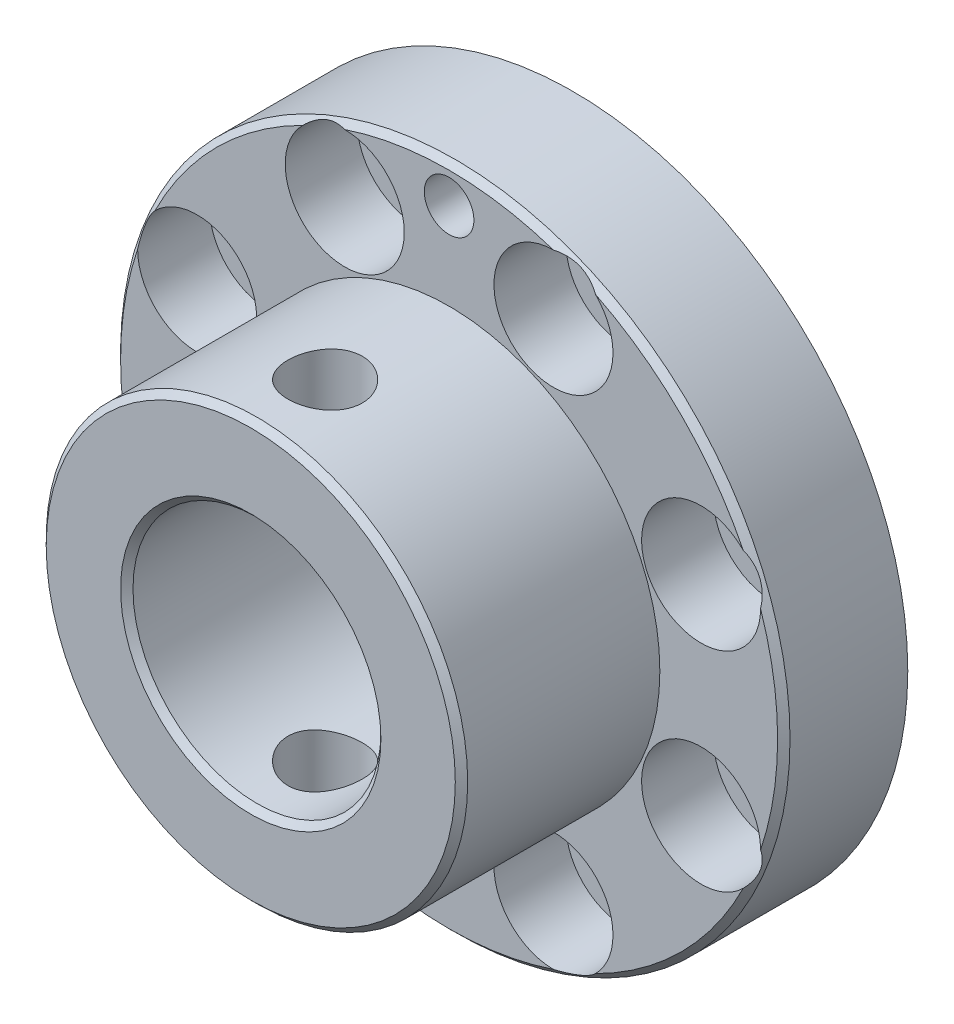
ISO-10303-21;
HEADER;
FILE_DESCRIPTION(('STEP AP214'),'2;1');
FILE_NAME('part.step','',(''),(''),'','','');
FILE_SCHEMA(('AUTOMOTIVE_DESIGN { 1 0 10303 214 1 1 1 1 }'));
ENDSEC;
DATA;
#1=APPLICATION_CONTEXT('core data for automotive mechanical design processes');
#2=APPLICATION_PROTOCOL_DEFINITION('international standard','automotive_design',2000,#1);
#3=PRODUCT_CONTEXT('',#1,'mechanical');
#4=PRODUCT('Part','Part','',(#3));
#5=PRODUCT_RELATED_PRODUCT_CATEGORY('part','',(#4));
#6=PRODUCT_DEFINITION_FORMATION('','',#4);
#7=PRODUCT_DEFINITION_CONTEXT('part definition',#1,'design');
#8=PRODUCT_DEFINITION('design','',#6,#7);
#9=PRODUCT_DEFINITION_SHAPE('','',#8);
#10=(LENGTH_UNIT() NAMED_UNIT(*) SI_UNIT(.MILLI.,.METRE.));
#11=(NAMED_UNIT(*) PLANE_ANGLE_UNIT() SI_UNIT($,.RADIAN.));
#12=(NAMED_UNIT(*) SI_UNIT($,.STERADIAN.) SOLID_ANGLE_UNIT());
#13=UNCERTAINTY_MEASURE_WITH_UNIT(LENGTH_MEASURE(1.E-05),#10,'distance_accuracy_value','');
#14=(GEOMETRIC_REPRESENTATION_CONTEXT(3) GLOBAL_UNCERTAINTY_ASSIGNED_CONTEXT((#13)) GLOBAL_UNIT_ASSIGNED_CONTEXT((#10,
#11,#12)) REPRESENTATION_CONTEXT('',''));
#15=CARTESIAN_POINT('',(0.,0.,0.));
#16=DIRECTION('',(0.,0.,1.));
#17=DIRECTION('',(1.,0.,0.));
#18=AXIS2_PLACEMENT_3D('',#15,#16,#17);
#19=CARTESIAN_POINT('',(0.,0.,13.));
#20=DIRECTION('',(0.,0.,1.));
#21=DIRECTION('',(1.,0.,0.));
#22=AXIS2_PLACEMENT_3D('',#19,#20,#21);
#23=PLANE('',#22);
#24=CARTESIAN_POINT('',(0.,0.,13.));
#25=DIRECTION('',(0.,0.,-1.));
#26=DIRECTION('',(1.,0.,0.));
#27=AXIS2_PLACEMENT_3D('',#24,#25,#26);
#28=CIRCLE('',#27,5.25);
#29=CARTESIAN_POINT('',(5.25,0.,13.));
#30=VERTEX_POINT('',#29);
#31=EDGE_CURVE('E359',#30,#30,#28,.T.);
#32=ORIENTED_EDGE('',*,*,#31,.T.);
#33=EDGE_LOOP('',(#32));
#34=FACE_BOUND('',#33,.T.);
#35=CARTESIAN_POINT('',(0.,0.,13.));
#36=DIRECTION('',(0.,0.,1.));
#37=DIRECTION('',(1.,0.,0.));
#38=AXIS2_PLACEMENT_3D('',#35,#36,#37);
#39=CIRCLE('',#38,8.25);
#40=CARTESIAN_POINT('',(8.25,0.,13.));
#41=VERTEX_POINT('',#40);
#42=EDGE_CURVE('E192',#41,#41,#39,.T.);
#43=ORIENTED_EDGE('',*,*,#42,.T.);
#44=EDGE_LOOP('',(#43));
#45=FACE_BOUND('',#44,.T.);
#46=ADVANCED_FACE('F17',(#34,#45),#23,.T.);
#47=CARTESIAN_POINT('',(-8.71267485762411,4.2095177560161,2.1));
#48=DIRECTION('',(0.,0.,-1.));
#49=DIRECTION('',(0.,-1.,0.));
#50=AXIS2_PLACEMENT_3D('',#47,#48,#49);
#51=PLANE('',#50);
#52=CARTESIAN_POINT('',(-10.1626748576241,4.2095177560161,2.1));
#53=DIRECTION('',(0.,0.,1.));
#54=DIRECTION('',(1.,0.,0.));
#55=AXIS2_PLACEMENT_3D('',#52,#53,#54);
#56=CIRCLE('',#55,1.45);
#57=CARTESIAN_POINT('',(-8.7126748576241,4.2095177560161,2.1));
#58=VERTEX_POINT('',#57);
#59=EDGE_CURVE('E418',#58,#58,#56,.T.);
#60=ORIENTED_EDGE('',*,*,#59,.F.);
#61=EDGE_LOOP('',(#60));
#62=FACE_BOUND('',#61,.T.);
#63=CARTESIAN_POINT('',(-10.1626748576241,4.2095177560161,2.1));
#64=DIRECTION('',(0.,0.,1.));
#65=DIRECTION('',(1.,0.,0.));
#66=AXIS2_PLACEMENT_3D('',#63,#64,#65);
#67=CIRCLE('',#66,2.4);
#68=CARTESIAN_POINT('',(-7.7626748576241,4.2095177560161,2.1));
#69=VERTEX_POINT('',#68);
#70=EDGE_CURVE('E121',#69,#69,#67,.T.);
#71=ORIENTED_EDGE('',*,*,#70,.T.);
#72=EDGE_LOOP('',(#71));
#73=FACE_BOUND('',#72,.T.);
#74=ADVANCED_FACE('F281',(#62,#73),#51,.F.);
#75=CARTESIAN_POINT('',(-8.71267485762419,-4.20951775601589,2.1));
#76=DIRECTION('',(0.,0.,-1.));
#77=DIRECTION('',(0.,-1.,0.));
#78=AXIS2_PLACEMENT_3D('',#75,#76,#77);
#79=PLANE('',#78);
#80=CARTESIAN_POINT('',(-10.1626748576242,-4.20951775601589,2.1));
#81=DIRECTION('',(0.,0.,1.));
#82=DIRECTION('',(1.,0.,0.));
#83=AXIS2_PLACEMENT_3D('',#80,#81,#82);
#84=CIRCLE('',#83,1.45);
#85=CARTESIAN_POINT('',(-8.7126748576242,-4.20951775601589,2.1));
#86=VERTEX_POINT('',#85);
#87=EDGE_CURVE('E386',#86,#86,#84,.T.);
#88=ORIENTED_EDGE('',*,*,#87,.F.);
#89=EDGE_LOOP('',(#88));
#90=FACE_BOUND('',#89,.T.);
#91=CARTESIAN_POINT('',(-10.1626748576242,-4.20951775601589,2.1));
#92=DIRECTION('',(0.,0.,1.));
#93=DIRECTION('',(1.,0.,0.));
#94=AXIS2_PLACEMENT_3D('',#91,#92,#93);
#95=CIRCLE('',#94,2.4);
#96=CARTESIAN_POINT('',(-7.7626748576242,-4.20951775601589,2.1));
#97=VERTEX_POINT('',#96);
#98=EDGE_CURVE('E422',#97,#97,#95,.T.);
#99=ORIENTED_EDGE('',*,*,#98,.T.);
#100=EDGE_LOOP('',(#99));
#101=FACE_BOUND('',#100,.T.);
#102=ADVANCED_FACE('F284',(#90,#101),#79,.F.);
#103=CARTESIAN_POINT('',(-2.75951775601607,-10.1626748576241,2.1));
#104=DIRECTION('',(0.,0.,-1.));
#105=DIRECTION('',(0.,-1.,0.));
#106=AXIS2_PLACEMENT_3D('',#103,#104,#105);
#107=PLANE('',#106);
#108=CARTESIAN_POINT('',(-4.20951775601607,-10.1626748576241,2.1));
#109=DIRECTION('',(0.,0.,1.));
#110=DIRECTION('',(1.,0.,0.));
#111=AXIS2_PLACEMENT_3D('',#108,#109,#110);
#112=CIRCLE('',#111,1.45);
#113=CARTESIAN_POINT('',(-2.75951775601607,-10.1626748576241,2.1));
#114=VERTEX_POINT('',#113);
#115=EDGE_CURVE('E390',#114,#114,#112,.T.);
#116=ORIENTED_EDGE('',*,*,#115,.F.);
#117=EDGE_LOOP('',(#116));
#118=FACE_BOUND('',#117,.T.);
#119=CARTESIAN_POINT('',(-4.20951775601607,-10.1626748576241,2.1));
#120=DIRECTION('',(0.,0.,1.));
#121=DIRECTION('',(1.,0.,0.));
#122=AXIS2_PLACEMENT_3D('',#119,#120,#121);
#123=CIRCLE('',#122,2.4);
#124=CARTESIAN_POINT('',(-1.80951775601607,-10.1626748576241,2.1));
#125=VERTEX_POINT('',#124);
#126=EDGE_CURVE('E429',#125,#125,#123,.T.);
#127=ORIENTED_EDGE('',*,*,#126,.T.);
#128=EDGE_LOOP('',(#127));
#129=FACE_BOUND('',#128,.T.);
#130=ADVANCED_FACE('F347',(#118,#129),#107,.F.);
#131=CARTESIAN_POINT('',(5.659517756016,-10.1626748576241,2.1));
#132=DIRECTION('',(0.,0.,-1.));
#133=DIRECTION('',(0.,-1.,0.));
#134=AXIS2_PLACEMENT_3D('',#131,#132,#133);
#135=PLANE('',#134);
#136=CARTESIAN_POINT('',(4.20951775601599,-10.1626748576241,2.1));
#137=DIRECTION('',(0.,0.,1.));
#138=DIRECTION('',(1.,0.,0.));
#139=AXIS2_PLACEMENT_3D('',#136,#137,#138);
#140=CIRCLE('',#139,1.45);
#141=CARTESIAN_POINT('',(5.65951775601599,-10.1626748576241,2.1));
#142=VERTEX_POINT('',#141);
#143=EDGE_CURVE('E434',#142,#142,#140,.T.);
#144=ORIENTED_EDGE('',*,*,#143,.F.);
#145=EDGE_LOOP('',(#144));
#146=FACE_BOUND('',#145,.T.);
#147=CARTESIAN_POINT('',(4.20951775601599,-10.1626748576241,2.1));
#148=DIRECTION('',(0.,0.,1.));
#149=DIRECTION('',(1.,0.,0.));
#150=AXIS2_PLACEMENT_3D('',#147,#148,#149);
#151=CIRCLE('',#150,2.4);
#152=CARTESIAN_POINT('',(6.609517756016,-10.1626748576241,2.1));
#153=VERTEX_POINT('',#152);
#154=EDGE_CURVE('E394',#153,#153,#151,.T.);
#155=ORIENTED_EDGE('',*,*,#154,.T.);
#156=EDGE_LOOP('',(#155));
#157=FACE_BOUND('',#156,.T.);
#158=ADVANCED_FACE('F341',(#146,#157),#135,.F.);
#159=CARTESIAN_POINT('',(11.6126748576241,-4.20951775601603,2.1));
#160=DIRECTION('',(0.,0.,-1.));
#161=DIRECTION('',(0.,-1.,0.));
#162=AXIS2_PLACEMENT_3D('',#159,#160,#161);
#163=PLANE('',#162);
#164=CARTESIAN_POINT('',(10.1626748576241,-4.20951775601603,2.1));
#165=DIRECTION('',(0.,0.,1.));
#166=DIRECTION('',(1.,0.,0.));
#167=AXIS2_PLACEMENT_3D('',#164,#165,#166);
#168=CIRCLE('',#167,1.45);
#169=CARTESIAN_POINT('',(11.6126748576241,-4.20951775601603,2.1));
#170=VERTEX_POINT('',#169);
#171=EDGE_CURVE('E466',#170,#170,#168,.T.);
#172=ORIENTED_EDGE('',*,*,#171,.F.);
#173=EDGE_LOOP('',(#172));
#174=FACE_BOUND('',#173,.T.);
#175=CARTESIAN_POINT('',(10.1626748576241,-4.20951775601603,2.1));
#176=DIRECTION('',(0.,0.,1.));
#177=DIRECTION('',(1.,0.,0.));
#178=AXIS2_PLACEMENT_3D('',#175,#176,#177);
#179=CIRCLE('',#178,2.4);
#180=CARTESIAN_POINT('',(12.5626748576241,-4.20951775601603,2.1));
#181=VERTEX_POINT('',#180);
#182=EDGE_CURVE('E438',#181,#181,#179,.T.);
#183=ORIENTED_EDGE('',*,*,#182,.T.);
#184=EDGE_LOOP('',(#183));
#185=FACE_BOUND('',#184,.T.);
#186=ADVANCED_FACE('F233',(#174,#185),#163,.F.);
#187=CARTESIAN_POINT('',(11.6126748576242,4.20951775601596,2.1));
#188=DIRECTION('',(0.,0.,-1.));
#189=DIRECTION('',(0.,-1.,0.));
#190=AXIS2_PLACEMENT_3D('',#187,#188,#189);
#191=PLANE('',#190);
#192=CARTESIAN_POINT('',(10.1626748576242,4.20951775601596,2.1));
#193=DIRECTION('',(0.,0.,1.));
#194=DIRECTION('',(1.,0.,0.));
#195=AXIS2_PLACEMENT_3D('',#192,#193,#194);
#196=CIRCLE('',#195,1.45);
#197=CARTESIAN_POINT('',(11.6126748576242,4.20951775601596,2.1));
#198=VERTEX_POINT('',#197);
#199=EDGE_CURVE('E452',#198,#198,#196,.T.);
#200=ORIENTED_EDGE('',*,*,#199,.F.);
#201=EDGE_LOOP('',(#200));
#202=FACE_BOUND('',#201,.T.);
#203=CARTESIAN_POINT('',(10.1626748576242,4.20951775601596,2.1));
#204=DIRECTION('',(0.,0.,1.));
#205=DIRECTION('',(1.,0.,0.));
#206=AXIS2_PLACEMENT_3D('',#203,#204,#205);
#207=CIRCLE('',#206,2.4);
#208=CARTESIAN_POINT('',(12.5626748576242,4.20951775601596,2.1));
#209=VERTEX_POINT('',#208);
#210=EDGE_CURVE('E470',#209,#209,#207,.T.);
#211=ORIENTED_EDGE('',*,*,#210,.T.);
#212=EDGE_LOOP('',(#211));
#213=FACE_BOUND('',#212,.T.);
#214=ADVANCED_FACE('F229',(#202,#213),#191,.F.);
#215=CARTESIAN_POINT('',(5.659517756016,10.1626748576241,2.1));
#216=DIRECTION('',(0.,0.,-1.));
#217=DIRECTION('',(0.,-1.,0.));
#218=AXIS2_PLACEMENT_3D('',#215,#216,#217);
#219=PLANE('',#218);
#220=CARTESIAN_POINT('',(4.20951775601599,10.1626748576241,2.1));
#221=DIRECTION('',(0.,0.,1.));
#222=DIRECTION('',(1.,0.,0.));
#223=AXIS2_PLACEMENT_3D('',#220,#221,#222);
#224=CIRCLE('',#223,1.45);
#225=CARTESIAN_POINT('',(5.65951775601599,10.1626748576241,2.1));
#226=VERTEX_POINT('',#225);
#227=EDGE_CURVE('E373',#226,#226,#224,.T.);
#228=ORIENTED_EDGE('',*,*,#227,.F.);
#229=EDGE_LOOP('',(#228));
#230=FACE_BOUND('',#229,.T.);
#231=CARTESIAN_POINT('',(4.20951775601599,10.1626748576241,2.1));
#232=DIRECTION('',(0.,0.,1.));
#233=DIRECTION('',(1.,0.,0.));
#234=AXIS2_PLACEMENT_3D('',#231,#232,#233);
#235=CIRCLE('',#234,2.4);
#236=CARTESIAN_POINT('',(6.609517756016,10.1626748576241,2.1));
#237=VERTEX_POINT('',#236);
#238=EDGE_CURVE('E400',#237,#237,#235,.T.);
#239=ORIENTED_EDGE('',*,*,#238,.T.);
#240=EDGE_LOOP('',(#239));
#241=FACE_BOUND('',#240,.T.);
#242=ADVANCED_FACE('F232',(#230,#241),#219,.F.);
#243=CARTESIAN_POINT('',(-2.75951775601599,10.1626748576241,2.1));
#244=DIRECTION('',(0.,0.,-1.));
#245=DIRECTION('',(0.,-1.,0.));
#246=AXIS2_PLACEMENT_3D('',#243,#244,#245);
#247=PLANE('',#246);
#248=CARTESIAN_POINT('',(-4.20951775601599,10.1626748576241,2.1));
#249=DIRECTION('',(0.,0.,1.));
#250=DIRECTION('',(1.,0.,0.));
#251=AXIS2_PLACEMENT_3D('',#248,#249,#250);
#252=CIRCLE('',#251,1.45);
#253=CARTESIAN_POINT('',(-2.75951775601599,10.1626748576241,2.1));
#254=VERTEX_POINT('',#253);
#255=EDGE_CURVE('E462',#254,#254,#252,.T.);
#256=ORIENTED_EDGE('',*,*,#255,.F.);
#257=EDGE_LOOP('',(#256));
#258=FACE_BOUND('',#257,.T.);
#259=CARTESIAN_POINT('',(-4.20951775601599,10.1626748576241,2.1));
#260=DIRECTION('',(0.,0.,1.));
#261=DIRECTION('',(1.,0.,0.));
#262=AXIS2_PLACEMENT_3D('',#259,#260,#261);
#263=CIRCLE('',#262,2.4);
#264=CARTESIAN_POINT('',(-1.809517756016,10.1626748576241,2.1));
#265=VERTEX_POINT('',#264);
#266=EDGE_CURVE('E377',#265,#265,#263,.T.);
#267=ORIENTED_EDGE('',*,*,#266,.T.);
#268=EDGE_LOOP('',(#267));
#269=FACE_BOUND('',#268,.T.);
#270=ADVANCED_FACE('F959',(#258,#269),#247,.F.);
#271=CARTESIAN_POINT('',(0.,0.,0.));
#272=DIRECTION('',(0.,0.,1.));
#273=DIRECTION('',(1.,0.,0.));
#274=AXIS2_PLACEMENT_3D('',#271,#272,#273);
#275=PLANE('',#274);
#276=CARTESIAN_POINT('',(0.,0.,0.));
#277=DIRECTION('',(0.,0.,1.));
#278=DIRECTION('',(1.,0.,0.));
#279=AXIS2_PLACEMENT_3D('',#276,#277,#278);
#280=CIRCLE('',#279,5.);
#281=CARTESIAN_POINT('',(5.,0.,0.));
#282=VERTEX_POINT('',#281);
#283=EDGE_CURVE('E457',#282,#282,#280,.T.);
#284=ORIENTED_EDGE('',*,*,#283,.T.);
#285=EDGE_LOOP('',(#284));
#286=FACE_BOUND('',#285,.T.);
#287=CARTESIAN_POINT('',(-4.20951775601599,10.1626748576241,0.));
#288=DIRECTION('',(0.,0.,1.));
#289=DIRECTION('',(1.,0.,0.));
#290=AXIS2_PLACEMENT_3D('',#287,#288,#289);
#291=CIRCLE('',#290,1.45);
#292=CARTESIAN_POINT('',(-2.75951775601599,10.1626748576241,0.));
#293=VERTEX_POINT('',#292);
#294=EDGE_CURVE('E445',#293,#293,#291,.T.);
#295=ORIENTED_EDGE('',*,*,#294,.T.);
#296=EDGE_LOOP('',(#295));
#297=FACE_BOUND('',#296,.T.);
#298=CARTESIAN_POINT('',(4.20951775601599,10.1626748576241,0.));
#299=DIRECTION('',(0.,0.,1.));
#300=DIRECTION('',(1.,0.,0.));
#301=AXIS2_PLACEMENT_3D('',#298,#299,#300);
#302=CIRCLE('',#301,1.45);
#303=CARTESIAN_POINT('',(5.65951775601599,10.1626748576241,0.));
#304=VERTEX_POINT('',#303);
#305=EDGE_CURVE('E378',#304,#304,#302,.T.);
#306=ORIENTED_EDGE('',*,*,#305,.T.);
#307=EDGE_LOOP('',(#306));
#308=FACE_BOUND('',#307,.T.);
#309=CARTESIAN_POINT('',(10.1626748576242,4.20951775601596,0.));
#310=DIRECTION('',(0.,0.,1.));
#311=DIRECTION('',(1.,0.,0.));
#312=AXIS2_PLACEMENT_3D('',#309,#310,#311);
#313=CIRCLE('',#312,1.45);
#314=CARTESIAN_POINT('',(11.6126748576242,4.20951775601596,0.));
#315=VERTEX_POINT('',#314);
#316=EDGE_CURVE('E477',#315,#315,#313,.T.);
#317=ORIENTED_EDGE('',*,*,#316,.T.);
#318=EDGE_LOOP('',(#317));
#319=FACE_BOUND('',#318,.T.);
#320=CARTESIAN_POINT('',(10.1626748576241,-4.20951775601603,0.));
#321=DIRECTION('',(0.,0.,1.));
#322=DIRECTION('',(1.,0.,0.));
#323=AXIS2_PLACEMENT_3D('',#320,#321,#322);
#324=CIRCLE('',#323,1.45);
#325=CARTESIAN_POINT('',(11.6126748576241,-4.20951775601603,0.));
#326=VERTEX_POINT('',#325);
#327=EDGE_CURVE('E152',#326,#326,#324,.T.);
#328=ORIENTED_EDGE('',*,*,#327,.T.);
#329=EDGE_LOOP('',(#328));
#330=FACE_BOUND('',#329,.T.);
#331=CARTESIAN_POINT('',(4.20951775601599,-10.1626748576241,0.));
#332=DIRECTION('',(0.,0.,1.));
#333=DIRECTION('',(1.,0.,0.));
#334=AXIS2_PLACEMENT_3D('',#331,#332,#333);
#335=CIRCLE('',#334,1.45);
#336=CARTESIAN_POINT('',(5.65951775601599,-10.1626748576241,0.));
#337=VERTEX_POINT('',#336);
#338=EDGE_CURVE('E430',#337,#337,#335,.T.);
#339=ORIENTED_EDGE('',*,*,#338,.T.);
#340=EDGE_LOOP('',(#339));
#341=FACE_BOUND('',#340,.T.);
#342=CARTESIAN_POINT('',(-4.20951775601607,-10.1626748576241,0.));
#343=DIRECTION('',(0.,0.,1.));
#344=DIRECTION('',(1.,0.,0.));
#345=AXIS2_PLACEMENT_3D('',#342,#343,#344);
#346=CIRCLE('',#345,1.45);
#347=CARTESIAN_POINT('',(-2.75951775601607,-10.1626748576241,0.));
#348=VERTEX_POINT('',#347);
#349=EDGE_CURVE('E307',#348,#348,#346,.T.);
#350=ORIENTED_EDGE('',*,*,#349,.T.);
#351=EDGE_LOOP('',(#350));
#352=FACE_BOUND('',#351,.T.);
#353=CARTESIAN_POINT('',(-10.1626748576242,-4.20951775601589,0.));
#354=DIRECTION('',(0.,0.,1.));
#355=DIRECTION('',(1.,0.,0.));
#356=AXIS2_PLACEMENT_3D('',#353,#354,#355);
#357=CIRCLE('',#356,1.45);
#358=CARTESIAN_POINT('',(-8.7126748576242,-4.20951775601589,0.));
#359=VERTEX_POINT('',#358);
#360=EDGE_CURVE('E314',#359,#359,#357,.T.);
#361=ORIENTED_EDGE('',*,*,#360,.T.);
#362=EDGE_LOOP('',(#361));
#363=FACE_BOUND('',#362,.T.);
#364=CARTESIAN_POINT('',(-10.1626748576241,4.2095177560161,0.));
#365=DIRECTION('',(0.,0.,1.));
#366=DIRECTION('',(1.,0.,0.));
#367=AXIS2_PLACEMENT_3D('',#364,#365,#366);
#368=CIRCLE('',#367,1.45);
#369=CARTESIAN_POINT('',(-8.7126748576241,4.2095177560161,0.));
#370=VERTEX_POINT('',#369);
#371=EDGE_CURVE('E120',#370,#370,#368,.T.);
#372=ORIENTED_EDGE('',*,*,#371,.T.);
#373=EDGE_LOOP('',(#372));
#374=FACE_BOUND('',#373,.T.);
#375=CARTESIAN_POINT('',(0.,12.,0.));
#376=DIRECTION('',(0.,0.,1.));
#377=DIRECTION('',(1.,0.,0.));
#378=AXIS2_PLACEMENT_3D('',#375,#376,#377);
#379=CIRCLE('',#378,1.);
#380=CARTESIAN_POINT('',(1.,12.,0.));
#381=VERTEX_POINT('',#380);
#382=EDGE_CURVE('E397',#381,#381,#379,.T.);
#383=ORIENTED_EDGE('',*,*,#382,.T.);
#384=EDGE_LOOP('',(#383));
#385=FACE_BOUND('',#384,.T.);
#386=CARTESIAN_POINT('',(0.,0.,0.));
#387=DIRECTION('',(0.,0.,1.));
#388=DIRECTION('',(1.,0.,0.));
#389=AXIS2_PLACEMENT_3D('',#386,#387,#388);
#390=CIRCLE('',#389,13.5);
#391=CARTESIAN_POINT('',(13.5,0.,0.));
#392=VERTEX_POINT('',#391);
#393=EDGE_CURVE('E461',#392,#392,#390,.T.);
#394=ORIENTED_EDGE('',*,*,#393,.F.);
#395=EDGE_LOOP('',(#394));
#396=FACE_BOUND('',#395,.T.);
#397=ADVANCED_FACE('F951',(#286,#297,#308,#319,#330,#341,#352,#363,#374,#385,#396),#275,.F.);
#398=CARTESIAN_POINT('',(0.,0.,5.));
#399=DIRECTION('',(0.,0.,1.));
#400=DIRECTION('',(1.,0.,0.));
#401=AXIS2_PLACEMENT_3D('',#398,#399,#400);
#402=PLANE('',#401);
#403=CARTESIAN_POINT('',(0.,0.,5.));
#404=DIRECTION('',(0.,0.,1.));
#405=DIRECTION('',(1.,0.,0.));
#406=AXIS2_PLACEMENT_3D('',#403,#404,#405);
#407=CIRCLE('',#406,8.5);
#408=CARTESIAN_POINT('',(8.5,0.,5.));
#409=VERTEX_POINT('',#408);
#410=EDGE_CURVE('E411',#409,#409,#407,.T.);
#411=ORIENTED_EDGE('',*,*,#410,.F.);
#412=EDGE_LOOP('',(#411));
#413=FACE_BOUND('',#412,.T.);
#414=CARTESIAN_POINT('',(0.,12.,5.));
#415=DIRECTION('',(0.,0.,1.));
#416=DIRECTION('',(1.,0.,0.));
#417=AXIS2_PLACEMENT_3D('',#414,#415,#416);
#418=CIRCLE('',#417,1.);
#419=CARTESIAN_POINT('',(1.,12.,5.));
#420=VERTEX_POINT('',#419);
#421=EDGE_CURVE('E404',#420,#420,#418,.T.);
#422=ORIENTED_EDGE('',*,*,#421,.F.);
#423=EDGE_LOOP('',(#422));
#424=FACE_BOUND('',#423,.T.);
#425=CARTESIAN_POINT('',(-4.20951775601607,-10.1626748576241,5.));
#426=DIRECTION('',(0.,0.,1.));
#427=DIRECTION('',(1.,0.,0.));
#428=AXIS2_PLACEMENT_3D('',#425,#426,#427);
#429=CIRCLE('',#428,2.4);
#430=CARTESIAN_POINT('',(-4.21209391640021,-12.5626734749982,5.));
#431=VERTEX_POINT('',#430);
#432=CARTESIAN_POINT('',(-5.90475143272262,-11.8615517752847,5.));
#433=VERTEX_POINT('',#432);
#434=EDGE_CURVE('E308',#431,#433,#429,.T.);
#435=ORIENTED_EDGE('',*,*,#434,.F.);
#436=CARTESIAN_POINT('',(0.,0.,5.));
#437=DIRECTION('',(0.,0.,1.));
#438=DIRECTION('',(1.,0.,0.));
#439=AXIS2_PLACEMENT_3D('',#436,#437,#438);
#440=CIRCLE('',#439,13.25);
#441=CARTESIAN_POINT('',(4.21209391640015,-12.5626734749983,5.00000000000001));
#442=VERTEX_POINT('',#441);
#443=EDGE_CURVE('E490',#431,#442,#440,.T.);
#444=ORIENTED_EDGE('',*,*,#443,.T.);
#445=CARTESIAN_POINT('',(4.20951775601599,-10.1626748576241,5.));
#446=DIRECTION('',(0.,0.,1.));
#447=DIRECTION('',(1.,0.,0.));
#448=AXIS2_PLACEMENT_3D('',#445,#446,#447);
#449=CIRCLE('',#448,2.4);
#450=CARTESIAN_POINT('',(5.90475143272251,-11.8615517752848,5.));
#451=VERTEX_POINT('',#450);
#452=EDGE_CURVE('E456',#451,#442,#449,.T.);
#453=ORIENTED_EDGE('',*,*,#452,.F.);
#454=CARTESIAN_POINT('',(0.,0.,5.));
#455=DIRECTION('',(0.,0.,1.));
#456=DIRECTION('',(1.,0.,0.));
#457=AXIS2_PLACEMENT_3D('',#454,#455,#456);
#458=CIRCLE('',#457,13.25);
#459=CARTESIAN_POINT('',(11.8615517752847,-5.90475143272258,5.));
#460=VERTEX_POINT('',#459);
#461=EDGE_CURVE('E33',#451,#460,#458,.T.);
#462=ORIENTED_EDGE('',*,*,#461,.T.);
#463=CARTESIAN_POINT('',(10.1626748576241,-4.20951775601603,5.));
#464=DIRECTION('',(0.,0.,1.));
#465=DIRECTION('',(1.,0.,0.));
#466=AXIS2_PLACEMENT_3D('',#463,#464,#465);
#467=CIRCLE('',#466,2.4);
#468=CARTESIAN_POINT('',(12.5626734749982,-4.21209391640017,5.));
#469=VERTEX_POINT('',#468);
#470=EDGE_CURVE('E153',#469,#460,#467,.T.);
#471=ORIENTED_EDGE('',*,*,#470,.F.);
#472=CARTESIAN_POINT('',(0.,0.,5.));
#473=DIRECTION('',(0.,0.,1.));
#474=DIRECTION('',(1.,0.,0.));
#475=AXIS2_PLACEMENT_3D('',#472,#473,#474);
#476=CIRCLE('',#475,13.25);
#477=CARTESIAN_POINT('',(12.5626734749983,4.21209391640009,5.));
#478=VERTEX_POINT('',#477);
#479=EDGE_CURVE('E48',#469,#478,#476,.T.);
#480=ORIENTED_EDGE('',*,*,#479,.T.);
#481=CARTESIAN_POINT('',(10.1626748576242,4.20951775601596,5.));
#482=DIRECTION('',(0.,0.,1.));
#483=DIRECTION('',(1.,0.,0.));
#484=AXIS2_PLACEMENT_3D('',#481,#482,#483);
#485=CIRCLE('',#484,2.4);
#486=CARTESIAN_POINT('',(11.8615517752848,5.90475143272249,5.));
#487=VERTEX_POINT('',#486);
#488=EDGE_CURVE('E474',#487,#478,#485,.T.);
#489=ORIENTED_EDGE('',*,*,#488,.F.);
#490=CARTESIAN_POINT('',(0.,0.,5.));
#491=DIRECTION('',(0.,0.,1.));
#492=DIRECTION('',(1.,0.,0.));
#493=AXIS2_PLACEMENT_3D('',#490,#491,#492);
#494=CIRCLE('',#493,13.25);
#495=CARTESIAN_POINT('',(5.90475143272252,11.8615517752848,5.));
#496=VERTEX_POINT('',#495);
#497=EDGE_CURVE('E193',#487,#496,#494,.T.);
#498=ORIENTED_EDGE('',*,*,#497,.T.);
#499=CARTESIAN_POINT('',(4.20951775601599,10.1626748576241,5.));
#500=DIRECTION('',(0.,0.,1.));
#501=DIRECTION('',(1.,0.,0.));
#502=AXIS2_PLACEMENT_3D('',#499,#500,#501);
#503=CIRCLE('',#502,2.4);
#504=CARTESIAN_POINT('',(4.21209391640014,12.5626734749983,5.));
#505=VERTEX_POINT('',#504);
#506=EDGE_CURVE('E382',#505,#496,#503,.T.);
#507=ORIENTED_EDGE('',*,*,#506,.F.);
#508=CARTESIAN_POINT('',(0.,0.,5.));
#509=DIRECTION('',(0.,0.,1.));
#510=DIRECTION('',(1.,0.,0.));
#511=AXIS2_PLACEMENT_3D('',#508,#509,#510);
#512=CIRCLE('',#511,13.25);
#513=CARTESIAN_POINT('',(-4.21209391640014,12.5626734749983,5.));
#514=VERTEX_POINT('',#513);
#515=EDGE_CURVE('E208',#505,#514,#512,.T.);
#516=ORIENTED_EDGE('',*,*,#515,.T.);
#517=CARTESIAN_POINT('',(-4.20951775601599,10.1626748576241,5.));
#518=DIRECTION('',(0.,0.,1.));
#519=DIRECTION('',(1.,0.,0.));
#520=AXIS2_PLACEMENT_3D('',#517,#518,#519);
#521=CIRCLE('',#520,2.4);
#522=CARTESIAN_POINT('',(-5.90475143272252,11.8615517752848,5.));
#523=VERTEX_POINT('',#522);
#524=EDGE_CURVE('E442',#523,#514,#521,.T.);
#525=ORIENTED_EDGE('',*,*,#524,.F.);
#526=CARTESIAN_POINT('',(0.,0.,5.));
#527=DIRECTION('',(0.,0.,1.));
#528=DIRECTION('',(1.,0.,0.));
#529=AXIS2_PLACEMENT_3D('',#526,#527,#528);
#530=CIRCLE('',#529,13.25);
#531=CARTESIAN_POINT('',(-11.8615517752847,5.90475143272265,5.));
#532=VERTEX_POINT('',#531);
#533=EDGE_CURVE('E117',#523,#532,#530,.T.);
#534=ORIENTED_EDGE('',*,*,#533,.T.);
#535=CARTESIAN_POINT('',(-10.1626748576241,4.2095177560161,5.));
#536=DIRECTION('',(0.,0.,1.));
#537=DIRECTION('',(1.,0.,0.));
#538=AXIS2_PLACEMENT_3D('',#535,#536,#537);
#539=CIRCLE('',#538,2.4);
#540=CARTESIAN_POINT('',(-12.5626734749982,4.21209391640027,5.));
#541=VERTEX_POINT('',#540);
#542=EDGE_CURVE('E106',#541,#532,#539,.T.);
#543=ORIENTED_EDGE('',*,*,#542,.F.);
#544=CARTESIAN_POINT('',(0.,0.,5.));
#545=DIRECTION('',(0.,0.,1.));
#546=DIRECTION('',(1.,0.,0.));
#547=AXIS2_PLACEMENT_3D('',#544,#545,#546);
#548=CIRCLE('',#547,13.25);
#549=CARTESIAN_POINT('',(-12.5626734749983,-4.21209391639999,5.));
#550=VERTEX_POINT('',#549);
#551=EDGE_CURVE('E114',#541,#550,#548,.T.);
#552=ORIENTED_EDGE('',*,*,#551,.T.);
#553=CARTESIAN_POINT('',(-10.1626748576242,-4.20951775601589,5.));
#554=DIRECTION('',(0.,0.,1.));
#555=DIRECTION('',(1.,0.,0.));
#556=AXIS2_PLACEMENT_3D('',#553,#554,#555);
#557=CIRCLE('',#556,2.4);
#558=CARTESIAN_POINT('',(-11.8615517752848,-5.90475143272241,5.));
#559=VERTEX_POINT('',#558);
#560=EDGE_CURVE('E315',#559,#550,#557,.T.);
#561=ORIENTED_EDGE('',*,*,#560,.F.);
#562=CARTESIAN_POINT('',(0.,0.,5.));
#563=DIRECTION('',(0.,0.,1.));
#564=DIRECTION('',(1.,0.,0.));
#565=AXIS2_PLACEMENT_3D('',#562,#563,#564);
#566=CIRCLE('',#565,13.25);
#567=EDGE_CURVE('E11',#559,#433,#566,.T.);
#568=ORIENTED_EDGE('',*,*,#567,.T.);
#569=EDGE_LOOP('',(#435,#444,#453,#462,#471,#480,#489,#498,#507,#516,#525,#534,#543,#552,#561,#568));
#570=FACE_BOUND('',#569,.T.);
#571=ADVANCED_FACE('F112',(#413,#424,#570),#402,.T.);
#572=CARTESIAN_POINT('',(0.,0.,5.));
#573=DIRECTION('',(0.,0.,-1.));
#574=DIRECTION('',(-1.,0.,0.));
#575=AXIS2_PLACEMENT_3D('',#572,#573,#574);
#576=CYLINDRICAL_SURFACE('',#575,13.5);
#577=ORIENTED_EDGE('',*,*,#393,.T.);
#578=EDGE_LOOP('',(#577));
#579=FACE_BOUND('',#578,.T.);
#580=CARTESIAN_POINT('',(0.,0.,4.75));
#581=DIRECTION('',(0.,0.,-1.));
#582=DIRECTION('',(1.,0.,0.));
#583=AXIS2_PLACEMENT_3D('',#580,#581,#582);
#584=CIRCLE('',#583,13.5);
#585=CARTESIAN_POINT('',(13.5,0.,4.75));
#586=VERTEX_POINT('',#585);
#587=EDGE_CURVE('E132',#586,#586,#584,.T.);
#588=ORIENTED_EDGE('',*,*,#587,.T.);
#589=EDGE_LOOP('',(#588));
#590=FACE_BOUND('',#589,.T.);
#591=ADVANCED_FACE('F239',(#579,#590),#576,.T.);
#592=CARTESIAN_POINT('',(0.,0.,5.));
#593=DIRECTION('',(0.,0.,-1.));
#594=DIRECTION('',(-1.,0.,0.));
#595=AXIS2_PLACEMENT_3D('',#592,#593,#594);
#596=CYLINDRICAL_SURFACE('',#595,5.);
#597=ORIENTED_EDGE('',*,*,#283,.F.);
#598=EDGE_LOOP('',(#597));
#599=FACE_BOUND('',#598,.T.);
#600=CARTESIAN_POINT('',(0.,-5.,8.5));
#601=CARTESIAN_POINT('',(-0.082182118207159,-4.99999703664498,8.50000446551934));
#602=CARTESIAN_POINT('',(-0.164454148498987,-4.99795161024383,8.50678475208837));
#603=CARTESIAN_POINT('',(-0.326683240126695,-4.9899803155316,8.53369094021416));
#604=CARTESIAN_POINT('',(-0.406635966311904,-4.98404761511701,8.55384033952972));
#605=CARTESIAN_POINT('',(-0.561741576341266,-4.9689541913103,8.6067503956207));
#606=CARTESIAN_POINT('',(-0.636903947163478,-4.95980009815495,8.63948516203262));
#607=CARTESIAN_POINT('',(-0.780646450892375,-4.93921757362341,8.71654984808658));
#608=CARTESIAN_POINT('',(-0.849227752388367,-4.92778954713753,8.76087770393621));
#609=CARTESIAN_POINT('',(-0.979869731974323,-4.90350769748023,8.86122262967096));
#610=CARTESIAN_POINT('',(-1.04171462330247,-4.89062453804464,8.91751355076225));
#611=CARTESIAN_POINT('',(-1.15524645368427,-4.86505903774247,9.03960563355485));
#612=CARTESIAN_POINT('',(-1.20693112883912,-4.85237674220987,9.10540890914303));
#613=CARTESIAN_POINT('',(-1.29980050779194,-4.82834110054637,9.24647097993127));
#614=CARTESIAN_POINT('',(-1.34072334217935,-4.81702399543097,9.32190893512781));
#615=CARTESIAN_POINT('',(-1.40921412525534,-4.79743615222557,9.4789897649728));
#616=CARTESIAN_POINT('',(-1.43678536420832,-4.78916466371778,9.56063110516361));
#617=CARTESIAN_POINT('',(-1.47701632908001,-4.77690871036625,9.72539023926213));
#618=CARTESIAN_POINT('',(-1.49007195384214,-4.77281069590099,9.80840268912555));
#619=CARTESIAN_POINT('',(-1.50213730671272,-4.76902789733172,9.97553310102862));
#620=CARTESIAN_POINT('',(-1.50115042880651,-4.76934204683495,10.0596507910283));
#621=CARTESIAN_POINT('',(-1.48546979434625,-4.77424743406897,10.2233836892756));
#622=CARTESIAN_POINT('',(-1.47127213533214,-4.77868386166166,10.3030518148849));
#623=CARTESIAN_POINT('',(-1.43037434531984,-4.79108351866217,10.4588193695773));
#624=CARTESIAN_POINT('',(-1.40367291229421,-4.79904711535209,10.5349184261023));
#625=CARTESIAN_POINT('',(-1.33815930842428,-4.81772760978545,10.6826025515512));
#626=CARTESIAN_POINT('',(-1.29918593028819,-4.82848080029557,10.7541113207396));
#627=CARTESIAN_POINT('',(-1.21034918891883,-4.85151059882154,10.8897358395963));
#628=CARTESIAN_POINT('',(-1.16048383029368,-4.86378748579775,10.9538502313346));
#629=CARTESIAN_POINT('',(-1.04882363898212,-4.88910774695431,11.0756747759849));
#630=CARTESIAN_POINT('',(-0.986618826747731,-4.90216176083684,11.1330075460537));
#631=CARTESIAN_POINT('',(-0.853288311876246,-4.92711805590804,11.2365370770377));
#632=CARTESIAN_POINT('',(-0.782158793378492,-4.93901984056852,11.2827290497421));
#633=CARTESIAN_POINT('',(-0.632291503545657,-4.96044128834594,11.3628957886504));
#634=CARTESIAN_POINT('',(-0.553501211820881,-4.96994262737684,11.3967773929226));
#635=CARTESIAN_POINT('',(-0.391079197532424,-4.98534581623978,11.4506368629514));
#636=CARTESIAN_POINT('',(-0.307457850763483,-4.99125508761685,11.4706434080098));
#637=CARTESIAN_POINT('',(-0.185912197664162,-4.99667992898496,11.4889025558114));
#638=CARTESIAN_POINT('',(-0.148868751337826,-4.99792152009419,11.4930594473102));
#639=CARTESIAN_POINT('',(-0.0745563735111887,-4.99958222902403,11.4986091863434));
#640=CARTESIAN_POINT('',(-0.0372874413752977,-5.00000134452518,11.500002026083));
#641=CARTESIAN_POINT('',(0.0821821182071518,-4.999997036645,11.4999955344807));
#642=CARTESIAN_POINT('',(0.164454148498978,-4.99795161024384,11.4932152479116));
#643=CARTESIAN_POINT('',(0.326683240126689,-4.98998031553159,11.4663090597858));
#644=CARTESIAN_POINT('',(0.406635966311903,-4.98404761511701,11.4461596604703));
#645=CARTESIAN_POINT('',(0.56174157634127,-4.96895419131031,11.3932496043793));
#646=CARTESIAN_POINT('',(0.636903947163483,-4.95980009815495,11.3605148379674));
#647=CARTESIAN_POINT('',(0.78064645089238,-4.93921757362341,11.2834501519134));
#648=CARTESIAN_POINT('',(0.849227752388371,-4.92778954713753,11.2391222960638));
#649=CARTESIAN_POINT('',(0.979869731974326,-4.90350769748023,11.138777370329));
#650=CARTESIAN_POINT('',(1.04171462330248,-4.89062453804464,11.0824864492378));
#651=CARTESIAN_POINT('',(1.15524645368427,-4.86505903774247,10.9603943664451));
#652=CARTESIAN_POINT('',(1.20693112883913,-4.85237674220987,10.894591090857));
#653=CARTESIAN_POINT('',(1.29980050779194,-4.82834110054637,10.7535290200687));
#654=CARTESIAN_POINT('',(1.34072334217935,-4.81702399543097,10.6780910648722));
#655=CARTESIAN_POINT('',(1.40921412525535,-4.79743615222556,10.5210102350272));
#656=CARTESIAN_POINT('',(1.43678536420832,-4.78916466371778,10.4393688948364));
#657=CARTESIAN_POINT('',(1.47701632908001,-4.77690871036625,10.2746097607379));
#658=CARTESIAN_POINT('',(1.49007195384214,-4.77281069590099,10.1915973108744));
#659=CARTESIAN_POINT('',(1.50213730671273,-4.76902789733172,10.0244668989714));
#660=CARTESIAN_POINT('',(1.50115042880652,-4.76934204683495,9.94034920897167));
#661=CARTESIAN_POINT('',(1.48546979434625,-4.77424743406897,9.77661631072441));
#662=CARTESIAN_POINT('',(1.47127213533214,-4.77868386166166,9.69694818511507));
#663=CARTESIAN_POINT('',(1.43037434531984,-4.79108351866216,9.54118063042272));
#664=CARTESIAN_POINT('',(1.40367291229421,-4.79904711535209,9.46508157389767));
#665=CARTESIAN_POINT('',(1.33815930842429,-4.81772760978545,9.31739744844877));
#666=CARTESIAN_POINT('',(1.29918593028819,-4.82848080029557,9.24588867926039));
#667=CARTESIAN_POINT('',(1.21034918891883,-4.85151059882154,9.11026416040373));
#668=CARTESIAN_POINT('',(1.16048383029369,-4.86378748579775,9.0461497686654));
#669=CARTESIAN_POINT('',(1.04882363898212,-4.88910774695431,8.92432522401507));
#670=CARTESIAN_POINT('',(0.986618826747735,-4.90216176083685,8.86699245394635));
#671=CARTESIAN_POINT('',(0.85328831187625,-4.92711805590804,8.7634629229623));
#672=CARTESIAN_POINT('',(0.782158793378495,-4.93901984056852,8.71727095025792));
#673=CARTESIAN_POINT('',(0.632291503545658,-4.96044128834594,8.63710421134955));
#674=CARTESIAN_POINT('',(0.553501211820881,-4.96994262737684,8.60322260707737));
#675=CARTESIAN_POINT('',(0.391079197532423,-4.98534581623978,8.54936313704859));
#676=CARTESIAN_POINT('',(0.307457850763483,-4.99125508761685,8.52935659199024));
#677=CARTESIAN_POINT('',(0.185912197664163,-4.99667992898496,8.51109744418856));
#678=CARTESIAN_POINT('',(0.148868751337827,-4.9979215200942,8.50694055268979));
#679=CARTESIAN_POINT('',(0.0745563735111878,-4.99958222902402,8.50139081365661));
#680=CARTESIAN_POINT('',(0.0372874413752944,-5.00000134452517,8.49999797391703));
#681=CARTESIAN_POINT('',(0.,-5.,8.5));
#682=B_SPLINE_CURVE_WITH_KNOTS('',3,(#600,#601,#602,#603,#604,#605,#606,#607,#608,#609,#610,
#611,#612,#613,#614,#615,#616,#617,#618,#619,#620,#621,#622,#623,#624,#625,#626,#627,#628,#629,
#630,#631,#632,#633,#634,#635,#636,#637,#638,#639,#640,#641,#642,#643,#644,#645,#646,#647,#648,
#649,#650,#651,#652,#653,#654,#655,#656,#657,#658,#659,#660,#661,#662,#663,#664,#665,#666,#667,
#668,#669,#670,#671,#672,#673,#674,#675,#676,#677,#678,#679,#680,#681),.UNSPECIFIED.,.T.,.F.,(4,
2,2,2,2,2,2,2,2,2,2,2,2,2,2,2,2,2,2,2,2,2,2,2,2,2,2,2,2,2,2,2,2,2,2,2,2,2,2,2,4),(0.,
0.246402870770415,0.493239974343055,0.739571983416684,0.985860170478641,1.2385491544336,
1.49129437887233,1.74971562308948,2.00807315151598,2.25919681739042,2.51025978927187,
2.75225951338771,2.99428444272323,3.23963153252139,3.48502360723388,3.74062425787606,
3.99633456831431,4.2539415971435,4.51101456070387,4.62281146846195,4.73460869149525,
4.98101156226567,5.22784866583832,5.47418067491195,5.72046886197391,5.97315784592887,
6.22590307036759,6.48432431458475,6.74268184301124,6.99380550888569,7.24486848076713,
7.48686820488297,7.72889313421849,7.97424022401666,8.21963229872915,8.47523294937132,
8.73094325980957,8.98855028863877,9.24562325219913,9.35742015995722,9.46921738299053),.UNSPECIFIED.);
#683=CARTESIAN_POINT('',(0.,-5.,8.5));
#684=VERTEX_POINT('',#683);
#685=EDGE_CURVE('E243',#684,#684,#682,.T.);
#686=ORIENTED_EDGE('',*,*,#685,.F.);
#687=EDGE_LOOP('',(#686));
#688=FACE_BOUND('',#687,.T.);
#689=CARTESIAN_POINT('',(0.,0.,12.75));
#690=DIRECTION('',(0.,0.,1.));
#691=DIRECTION('',(1.,0.,0.));
#692=AXIS2_PLACEMENT_3D('',#689,#690,#691);
#693=CIRCLE('',#692,5.);
#694=CARTESIAN_POINT('',(5.,0.,12.75));
#695=VERTEX_POINT('',#694);
#696=EDGE_CURVE('E369',#695,#695,#693,.T.);
#697=ORIENTED_EDGE('',*,*,#696,.T.);
#698=EDGE_LOOP('',(#697));
#699=FACE_BOUND('',#698,.T.);
#700=CARTESIAN_POINT('',(0.,5.,11.5));
#701=CARTESIAN_POINT('',(-0.0821821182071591,4.99999703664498,11.4999955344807));
#702=CARTESIAN_POINT('',(-0.164454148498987,4.99795161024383,11.4932152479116));
#703=CARTESIAN_POINT('',(-0.326683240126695,4.9899803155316,11.4663090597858));
#704=CARTESIAN_POINT('',(-0.406635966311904,4.98404761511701,11.4461596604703));
#705=CARTESIAN_POINT('',(-0.561741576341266,4.9689541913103,11.3932496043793));
#706=CARTESIAN_POINT('',(-0.636903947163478,4.95980009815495,11.3605148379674));
#707=CARTESIAN_POINT('',(-0.780646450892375,4.93921757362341,11.2834501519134));
#708=CARTESIAN_POINT('',(-0.849227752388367,4.92778954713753,11.2391222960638));
#709=CARTESIAN_POINT('',(-0.979869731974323,4.90350769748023,11.138777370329));
#710=CARTESIAN_POINT('',(-1.04171462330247,4.89062453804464,11.0824864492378));
#711=CARTESIAN_POINT('',(-1.15524645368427,4.86505903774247,10.9603943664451));
#712=CARTESIAN_POINT('',(-1.20693112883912,4.85237674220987,10.894591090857));
#713=CARTESIAN_POINT('',(-1.29980050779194,4.82834110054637,10.7535290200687));
#714=CARTESIAN_POINT('',(-1.34072334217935,4.81702399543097,10.6780910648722));
#715=CARTESIAN_POINT('',(-1.40921412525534,4.79743615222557,10.5210102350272));
#716=CARTESIAN_POINT('',(-1.43678536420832,4.78916466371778,10.4393688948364));
#717=CARTESIAN_POINT('',(-1.47701632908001,4.77690871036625,10.2746097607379));
#718=CARTESIAN_POINT('',(-1.49007195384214,4.77281069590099,10.1915973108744));
#719=CARTESIAN_POINT('',(-1.50213730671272,4.76902789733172,10.0244668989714));
#720=CARTESIAN_POINT('',(-1.50115042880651,4.76934204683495,9.94034920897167));
#721=CARTESIAN_POINT('',(-1.48546979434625,4.77424743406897,9.77661631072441));
#722=CARTESIAN_POINT('',(-1.47127213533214,4.77868386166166,9.69694818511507));
#723=CARTESIAN_POINT('',(-1.43037434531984,4.79108351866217,9.54118063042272));
#724=CARTESIAN_POINT('',(-1.40367291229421,4.79904711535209,9.46508157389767));
#725=CARTESIAN_POINT('',(-1.33815930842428,4.81772760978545,9.31739744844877));
#726=CARTESIAN_POINT('',(-1.29918593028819,4.82848080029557,9.24588867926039));
#727=CARTESIAN_POINT('',(-1.21034918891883,4.85151059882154,9.11026416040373));
#728=CARTESIAN_POINT('',(-1.16048383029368,4.86378748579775,9.0461497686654));
#729=CARTESIAN_POINT('',(-1.04882363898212,4.88910774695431,8.92432522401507));
#730=CARTESIAN_POINT('',(-0.986618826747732,4.90216176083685,8.86699245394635));
#731=CARTESIAN_POINT('',(-0.853288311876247,4.92711805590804,8.7634629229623));
#732=CARTESIAN_POINT('',(-0.782158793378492,4.93901984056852,8.71727095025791));
#733=CARTESIAN_POINT('',(-0.632291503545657,4.96044128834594,8.63710421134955));
#734=CARTESIAN_POINT('',(-0.553501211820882,4.96994262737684,8.60322260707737));
#735=CARTESIAN_POINT('',(-0.391079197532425,4.98534581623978,8.54936313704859));
#736=CARTESIAN_POINT('',(-0.307457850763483,4.99125508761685,8.52935659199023));
#737=CARTESIAN_POINT('',(-0.185912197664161,4.99667992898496,8.51109744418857));
#738=CARTESIAN_POINT('',(-0.148868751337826,4.99792152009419,8.50694055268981));
#739=CARTESIAN_POINT('',(-0.0745563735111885,4.99958222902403,8.5013908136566));
#740=CARTESIAN_POINT('',(-0.0372874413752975,5.00000134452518,8.49999797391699));
#741=CARTESIAN_POINT('',(0.082182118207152,4.999997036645,8.50000446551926));
#742=CARTESIAN_POINT('',(0.164454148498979,4.99795161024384,8.50678475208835));
#743=CARTESIAN_POINT('',(0.326683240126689,4.98998031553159,8.53369094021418));
#744=CARTESIAN_POINT('',(0.406635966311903,4.98404761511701,8.55384033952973));
#745=CARTESIAN_POINT('',(0.56174157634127,4.96895419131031,8.6067503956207));
#746=CARTESIAN_POINT('',(0.636903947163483,4.95980009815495,8.63948516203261));
#747=CARTESIAN_POINT('',(0.78064645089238,4.93921757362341,8.71654984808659));
#748=CARTESIAN_POINT('',(0.849227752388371,4.92778954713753,8.76087770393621));
#749=CARTESIAN_POINT('',(0.979869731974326,4.90350769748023,8.86122262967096));
#750=CARTESIAN_POINT('',(1.04171462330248,4.89062453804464,8.91751355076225));
#751=CARTESIAN_POINT('',(1.15524645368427,4.86505903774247,9.03960563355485));
#752=CARTESIAN_POINT('',(1.20693112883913,4.85237674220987,9.10540890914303));
#753=CARTESIAN_POINT('',(1.29980050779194,4.82834110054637,9.24647097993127));
#754=CARTESIAN_POINT('',(1.34072334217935,4.81702399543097,9.32190893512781));
#755=CARTESIAN_POINT('',(1.40921412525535,4.79743615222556,9.4789897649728));
#756=CARTESIAN_POINT('',(1.43678536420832,4.78916466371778,9.56063110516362));
#757=CARTESIAN_POINT('',(1.47701632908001,4.77690871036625,9.72539023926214));
#758=CARTESIAN_POINT('',(1.49007195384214,4.77281069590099,9.80840268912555));
#759=CARTESIAN_POINT('',(1.50213730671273,4.76902789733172,9.97553310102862));
#760=CARTESIAN_POINT('',(1.50115042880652,4.76934204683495,10.0596507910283));
#761=CARTESIAN_POINT('',(1.48546979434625,4.77424743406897,10.2233836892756));
#762=CARTESIAN_POINT('',(1.47127213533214,4.77868386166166,10.3030518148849));
#763=CARTESIAN_POINT('',(1.43037434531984,4.79108351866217,10.4588193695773));
#764=CARTESIAN_POINT('',(1.40367291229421,4.79904711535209,10.5349184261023));
#765=CARTESIAN_POINT('',(1.33815930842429,4.81772760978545,10.6826025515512));
#766=CARTESIAN_POINT('',(1.29918593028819,4.82848080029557,10.7541113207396));
#767=CARTESIAN_POINT('',(1.21034918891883,4.85151059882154,10.8897358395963));
#768=CARTESIAN_POINT('',(1.16048383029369,4.86378748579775,10.9538502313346));
#769=CARTESIAN_POINT('',(1.04882363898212,4.88910774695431,11.0756747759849));
#770=CARTESIAN_POINT('',(0.986618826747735,4.90216176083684,11.1330075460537));
#771=CARTESIAN_POINT('',(0.85328831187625,4.92711805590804,11.2365370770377));
#772=CARTESIAN_POINT('',(0.782158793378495,4.93901984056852,11.2827290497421));
#773=CARTESIAN_POINT('',(0.632291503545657,4.96044128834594,11.3628957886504));
#774=CARTESIAN_POINT('',(0.553501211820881,4.96994262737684,11.3967773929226));
#775=CARTESIAN_POINT('',(0.391079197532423,4.98534581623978,11.4506368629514));
#776=CARTESIAN_POINT('',(0.307457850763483,4.99125508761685,11.4706434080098));
#777=CARTESIAN_POINT('',(0.185912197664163,4.99667992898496,11.4889025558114));
#778=CARTESIAN_POINT('',(0.148868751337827,4.9979215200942,11.4930594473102));
#779=CARTESIAN_POINT('',(0.0745563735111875,4.99958222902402,11.4986091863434));
#780=CARTESIAN_POINT('',(0.0372874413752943,5.00000134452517,11.500002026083));
#781=CARTESIAN_POINT('',(0.,5.,11.5));
#782=B_SPLINE_CURVE_WITH_KNOTS('',3,(#700,#701,#702,#703,#704,#705,#706,#707,#708,#709,#710,
#711,#712,#713,#714,#715,#716,#717,#718,#719,#720,#721,#722,#723,#724,#725,#726,#727,#728,#729,
#730,#731,#732,#733,#734,#735,#736,#737,#738,#739,#740,#741,#742,#743,#744,#745,#746,#747,#748,
#749,#750,#751,#752,#753,#754,#755,#756,#757,#758,#759,#760,#761,#762,#763,#764,#765,#766,#767,
#768,#769,#770,#771,#772,#773,#774,#775,#776,#777,#778,#779,#780,#781),.UNSPECIFIED.,.T.,.F.,(4,
2,2,2,2,2,2,2,2,2,2,2,2,2,2,2,2,2,2,2,2,2,2,2,2,2,2,2,2,2,2,2,2,2,2,2,2,2,2,2,4),(0.,
0.246402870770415,0.493239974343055,0.739571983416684,0.985860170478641,1.2385491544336,
1.49129437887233,1.74971562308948,2.00807315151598,2.25919681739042,2.51025978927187,
2.75225951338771,2.99428444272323,3.23963153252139,3.48502360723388,3.74062425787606,
3.99633456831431,4.2539415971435,4.51101456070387,4.62281146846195,4.73460869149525,
4.98101156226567,5.22784866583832,5.47418067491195,5.72046886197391,5.97315784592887,
6.22590307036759,6.48432431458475,6.74268184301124,6.99380550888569,7.24486848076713,
7.48686820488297,7.72889313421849,7.97424022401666,8.21963229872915,8.47523294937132,
8.73094325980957,8.98855028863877,9.24562325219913,9.35742015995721,9.46921738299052),.UNSPECIFIED.);
#783=CARTESIAN_POINT('',(0.,5.,11.5));
#784=VERTEX_POINT('',#783);
#785=EDGE_CURVE('E248',#784,#784,#782,.T.);
#786=ORIENTED_EDGE('',*,*,#785,.F.);
#787=EDGE_LOOP('',(#786));
#788=FACE_BOUND('',#787,.T.);
#789=ADVANCED_FACE('F235',(#599,#688,#699,#788),#596,.F.);
#790=CARTESIAN_POINT('',(-4.20951775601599,10.1626748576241,5.));
#791=DIRECTION('',(0.,0.,1.));
#792=DIRECTION('',(1.,0.,0.));
#793=AXIS2_PLACEMENT_3D('',#790,#791,#792);
#794=CYLINDRICAL_SURFACE('',#793,1.45);
#795=ORIENTED_EDGE('',*,*,#255,.T.);
#796=EDGE_LOOP('',(#795));
#797=FACE_BOUND('',#796,.T.);
#798=ORIENTED_EDGE('',*,*,#294,.F.);
#799=EDGE_LOOP('',(#798));
#800=FACE_BOUND('',#799,.T.);
#801=ADVANCED_FACE('F227',(#797,#800),#794,.F.);
#802=CARTESIAN_POINT('',(-4.20951775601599,10.1626748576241,5.));
#803=DIRECTION('',(0.,0.,1.));
#804=DIRECTION('',(1.,0.,0.));
#805=AXIS2_PLACEMENT_3D('',#802,#803,#804);
#806=CYLINDRICAL_SURFACE('',#805,2.4);
#807=CARTESIAN_POINT('',(-4.21209391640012,12.5626734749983,5.00000000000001));
#808=CARTESIAN_POINT('',(-4.26359221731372,12.5626243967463,4.98367705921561));
#809=CARTESIAN_POINT('',(-4.31547633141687,12.5609048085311,4.96854221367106));
#810=CARTESIAN_POINT('',(-4.41971435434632,12.5540217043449,4.94079983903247));
#811=CARTESIAN_POINT('',(-4.47206847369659,12.5488565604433,4.92819350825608));
#812=CARTESIAN_POINT('',(-4.57680925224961,12.5349906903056,4.9056935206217));
#813=CARTESIAN_POINT('',(-4.62919571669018,12.5262957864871,4.89579544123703));
#814=CARTESIAN_POINT('',(-4.73368752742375,12.5053424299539,4.87881411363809));
#815=CARTESIAN_POINT('',(-4.78579292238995,12.4930846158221,4.87173036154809));
#816=CARTESIAN_POINT('',(-4.94151405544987,12.4508469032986,4.8548239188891));
#817=CARTESIAN_POINT('',(-5.04423758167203,12.4154412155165,4.8494103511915));
#818=CARTESIAN_POINT('',(-5.24380201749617,12.3310874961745,4.85069334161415));
#819=CARTESIAN_POINT('',(-5.34064341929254,12.2821405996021,4.85738888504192));
#820=CARTESIAN_POINT('',(-5.52049400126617,12.175542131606,4.88177192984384));
#821=CARTESIAN_POINT('',(-5.60397597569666,12.1185406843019,4.89881531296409));
#822=CARTESIAN_POINT('',(-5.72217314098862,12.0266445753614,4.93155219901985));
#823=CARTESIAN_POINT('',(-5.76043448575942,11.9949134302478,4.94367484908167));
#824=CARTESIAN_POINT('',(-5.83447394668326,11.9295794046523,4.9701772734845));
#825=CARTESIAN_POINT('',(-5.87025296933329,11.895977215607,4.98455621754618));
#826=CARTESIAN_POINT('',(-5.90475143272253,11.8615517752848,5.00000000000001));
#827=B_SPLINE_CURVE_WITH_KNOTS('',3,(#807,#808,#809,#810,#811,#812,#813,#814,#815,#816,#817,
#818,#819,#820,#821,#822,#823,#824,#825,#826),.UNSPECIFIED.,.F.,.F.,(4,2,2,2,2,2,2,2,2,4),(0.,
0.162044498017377,0.324165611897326,0.486020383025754,0.647846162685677,0.972405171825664,
1.29693698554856,1.6030858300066,1.7564542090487,1.9097662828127),.UNSPECIFIED.);
#828=EDGE_CURVE('E209',#514,#523,#827,.T.);
#829=ORIENTED_EDGE('',*,*,#828,.T.);
#830=ORIENTED_EDGE('',*,*,#524,.T.);
#831=EDGE_LOOP('',(#829,#830));
#832=FACE_BOUND('',#831,.T.);
#833=ORIENTED_EDGE('',*,*,#266,.F.);
#834=EDGE_LOOP('',(#833));
#835=FACE_BOUND('',#834,.T.);
#836=ADVANCED_FACE('F222',(#832,#835),#806,.F.);
#837=CARTESIAN_POINT('',(4.20951775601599,10.1626748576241,5.));
#838=DIRECTION('',(0.,0.,1.));
#839=DIRECTION('',(1.,0.,0.));
#840=AXIS2_PLACEMENT_3D('',#837,#838,#839);
#841=CYLINDRICAL_SURFACE('',#840,1.45);
#842=ORIENTED_EDGE('',*,*,#227,.T.);
#843=EDGE_LOOP('',(#842));
#844=FACE_BOUND('',#843,.T.);
#845=ORIENTED_EDGE('',*,*,#305,.F.);
#846=EDGE_LOOP('',(#845));
#847=FACE_BOUND('',#846,.T.);
#848=ADVANCED_FACE('F219',(#844,#847),#841,.F.);
#849=CARTESIAN_POINT('',(4.20951775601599,10.1626748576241,5.));
#850=DIRECTION('',(0.,0.,1.));
#851=DIRECTION('',(1.,0.,0.));
#852=AXIS2_PLACEMENT_3D('',#849,#850,#851);
#853=CYLINDRICAL_SURFACE('',#852,2.4);
#854=CARTESIAN_POINT('',(5.90475143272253,11.8615517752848,5.00000000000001));
#855=CARTESIAN_POINT('',(5.86830193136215,11.8979318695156,4.98367705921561));
#856=CARTESIAN_POINT('',(5.83039838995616,11.933403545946,4.96854221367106));
#857=CARTESIAN_POINT('',(5.75182388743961,12.0022438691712,4.94079983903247));
#858=CARTESIAN_POINT('',(5.71115162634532,12.0356115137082,4.92819350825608));
#859=CARTESIAN_POINT('',(5.62728406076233,12.0998697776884,4.9056935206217));
#860=CARTESIAN_POINT('',(5.58409301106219,12.1307643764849,4.89579544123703));
#861=CARTESIAN_POINT('',(5.4953898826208,12.1898349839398,4.87881411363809));
#862=CARTESIAN_POINT('',(5.44987822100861,12.2180114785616,4.87173036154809));
#863=CARTESIAN_POINT('',(5.30990017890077,12.2982563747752,4.8548239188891));
#864=CARTESIAN_POINT('',(5.21222807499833,12.345857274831,4.8494103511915));
#865=CARTESIAN_POINT('',(5.01146762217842,12.4273235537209,4.85069334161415));
#866=CARTESIAN_POINT('',(4.9083797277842,12.4611900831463,4.85738888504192));
#867=CARTESIAN_POINT('',(4.70582966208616,12.5129871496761,4.88177192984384));
#868=CARTESIAN_POINT('',(4.60649288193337,12.5317117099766,4.89881531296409));
#869=CARTESIAN_POINT('',(4.4579345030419,12.550309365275,4.93155219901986));
#870=CARTESIAN_POINT('',(4.40844233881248,12.5549269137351,4.94367484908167));
#871=CARTESIAN_POINT('',(4.30989040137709,12.561082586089,4.9701772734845));
#872=CARTESIAN_POINT('',(4.26083047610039,12.5626218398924,4.98455621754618));
#873=CARTESIAN_POINT('',(4.21209391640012,12.5626734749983,5.00000000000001));
#874=B_SPLINE_CURVE_WITH_KNOTS('',3,(#854,#855,#856,#857,#858,#859,#860,#861,#862,#863,#864,
#865,#866,#867,#868,#869,#870,#871,#872,#873),.UNSPECIFIED.,.F.,.F.,(4,2,2,2,2,2,2,2,2,4),(0.,
0.162044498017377,0.324165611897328,0.486020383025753,0.647846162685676,0.972405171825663,
1.29693698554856,1.6030858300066,1.7564542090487,1.9097662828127),.UNSPECIFIED.);
#875=EDGE_CURVE('E201',#496,#505,#874,.T.);
#876=ORIENTED_EDGE('',*,*,#875,.T.);
#877=ORIENTED_EDGE('',*,*,#506,.T.);
#878=EDGE_LOOP('',(#876,#877));
#879=FACE_BOUND('',#878,.T.);
#880=ORIENTED_EDGE('',*,*,#238,.F.);
#881=EDGE_LOOP('',(#880));
#882=FACE_BOUND('',#881,.T.);
#883=ADVANCED_FACE('F215',(#879,#882),#853,.F.);
#884=CARTESIAN_POINT('',(10.1626748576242,4.20951775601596,5.));
#885=DIRECTION('',(0.,0.,1.));
#886=DIRECTION('',(1.,0.,0.));
#887=AXIS2_PLACEMENT_3D('',#884,#885,#886);
#888=CYLINDRICAL_SURFACE('',#887,1.45);
#889=ORIENTED_EDGE('',*,*,#199,.T.);
#890=EDGE_LOOP('',(#889));
#891=FACE_BOUND('',#890,.T.);
#892=ORIENTED_EDGE('',*,*,#316,.F.);
#893=EDGE_LOOP('',(#892));
#894=FACE_BOUND('',#893,.T.);
#895=ADVANCED_FACE('F179',(#891,#894),#888,.F.);
#896=CARTESIAN_POINT('',(10.1626748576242,4.20951775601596,5.));
#897=DIRECTION('',(0.,0.,1.));
#898=DIRECTION('',(1.,0.,0.));
#899=AXIS2_PLACEMENT_3D('',#896,#897,#898);
#900=CYLINDRICAL_SURFACE('',#899,2.4);
#901=CARTESIAN_POINT('',(12.5626734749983,4.21209391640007,5.00000000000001));
#902=CARTESIAN_POINT('',(12.5626243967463,4.26359221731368,4.98367705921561));
#903=CARTESIAN_POINT('',(12.5609048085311,4.31547633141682,4.96854221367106));
#904=CARTESIAN_POINT('',(12.5540217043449,4.41971435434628,4.94079983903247));
#905=CARTESIAN_POINT('',(12.5488565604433,4.47206847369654,4.92819350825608));
#906=CARTESIAN_POINT('',(12.5349906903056,4.57680925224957,4.9056935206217));
#907=CARTESIAN_POINT('',(12.5262957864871,4.62919571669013,4.89579544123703));
#908=CARTESIAN_POINT('',(12.505342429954,4.73368752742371,4.87881411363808));
#909=CARTESIAN_POINT('',(12.4930846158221,4.7857929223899,4.87173036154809));
#910=CARTESIAN_POINT('',(12.4508469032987,4.94151405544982,4.85482391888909));
#911=CARTESIAN_POINT('',(12.4154412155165,5.04423758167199,4.84941035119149));
#912=CARTESIAN_POINT('',(12.3310874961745,5.24380201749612,4.85069334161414));
#913=CARTESIAN_POINT('',(12.2821405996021,5.3406434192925,4.85738888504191));
#914=CARTESIAN_POINT('',(12.175542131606,5.52049400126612,4.88177192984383));
#915=CARTESIAN_POINT('',(12.118540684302,5.60397597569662,4.89881531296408));
#916=CARTESIAN_POINT('',(12.0266445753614,5.72217314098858,4.93155219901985));
#917=CARTESIAN_POINT('',(11.9949134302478,5.76043448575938,4.94367484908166));
#918=CARTESIAN_POINT('',(11.9295794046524,5.83447394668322,4.9701772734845));
#919=CARTESIAN_POINT('',(11.8959772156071,5.87025296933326,4.98455621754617));
#920=CARTESIAN_POINT('',(11.8615517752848,5.9047514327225,5.00000000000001));
#921=B_SPLINE_CURVE_WITH_KNOTS('',3,(#901,#902,#903,#904,#905,#906,#907,#908,#909,#910,#911,
#912,#913,#914,#915,#916,#917,#918,#919,#920),.UNSPECIFIED.,.F.,.F.,(4,2,2,2,2,2,2,2,2,4),(0.,
0.162044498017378,0.324165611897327,0.486020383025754,0.647846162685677,0.972405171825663,
1.29693698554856,1.6030858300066,1.75645420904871,1.90976628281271),.UNSPECIFIED.);
#922=EDGE_CURVE('E183',#478,#487,#921,.T.);
#923=ORIENTED_EDGE('',*,*,#922,.T.);
#924=ORIENTED_EDGE('',*,*,#488,.T.);
#925=EDGE_LOOP('',(#923,#924));
#926=FACE_BOUND('',#925,.T.);
#927=ORIENTED_EDGE('',*,*,#210,.F.);
#928=EDGE_LOOP('',(#927));
#929=FACE_BOUND('',#928,.T.);
#930=ADVANCED_FACE('F174',(#926,#929),#900,.F.);
#931=CARTESIAN_POINT('',(10.1626748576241,-4.20951775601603,5.));
#932=DIRECTION('',(0.,0.,1.));
#933=DIRECTION('',(1.,0.,0.));
#934=AXIS2_PLACEMENT_3D('',#931,#932,#933);
#935=CYLINDRICAL_SURFACE('',#934,1.45);
#936=ORIENTED_EDGE('',*,*,#171,.T.);
#937=EDGE_LOOP('',(#936));
#938=FACE_BOUND('',#937,.T.);
#939=ORIENTED_EDGE('',*,*,#327,.F.);
#940=EDGE_LOOP('',(#939));
#941=FACE_BOUND('',#940,.T.);
#942=ADVANCED_FACE('F169',(#938,#941),#935,.F.);
#943=CARTESIAN_POINT('',(10.1626748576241,-4.20951775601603,5.));
#944=DIRECTION('',(0.,0.,1.));
#945=DIRECTION('',(1.,0.,0.));
#946=AXIS2_PLACEMENT_3D('',#943,#944,#945);
#947=CYLINDRICAL_SURFACE('',#946,2.4);
#948=CARTESIAN_POINT('',(11.8615517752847,-5.90475143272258,5.));
#949=CARTESIAN_POINT('',(11.8979318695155,-5.8683019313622,4.9836770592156));
#950=CARTESIAN_POINT('',(11.9334035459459,-5.83039838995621,4.96854221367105));
#951=CARTESIAN_POINT('',(12.0022438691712,-5.75182388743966,4.94079983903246));
#952=CARTESIAN_POINT('',(12.0356115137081,-5.71115162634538,4.92819350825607));
#953=CARTESIAN_POINT('',(12.0998697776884,-5.62728406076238,4.90569352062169));
#954=CARTESIAN_POINT('',(12.1307643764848,-5.58409301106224,4.89579544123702));
#955=CARTESIAN_POINT('',(12.1898349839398,-5.49538988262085,4.87881411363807));
#956=CARTESIAN_POINT('',(12.2180114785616,-5.44987822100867,4.87173036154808));
#957=CARTESIAN_POINT('',(12.2982563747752,-5.30990017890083,4.85482391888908));
#958=CARTESIAN_POINT('',(12.3458572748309,-5.21222807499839,4.84941035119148));
#959=CARTESIAN_POINT('',(12.4273235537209,-5.01146762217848,4.85069334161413));
#960=CARTESIAN_POINT('',(12.4611900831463,-4.90837972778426,4.8573888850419));
#961=CARTESIAN_POINT('',(12.5129871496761,-4.70582966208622,4.88177192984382));
#962=CARTESIAN_POINT('',(12.5317117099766,-4.60649288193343,4.89881531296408));
#963=CARTESIAN_POINT('',(12.550309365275,-4.45793450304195,4.93155219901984));
#964=CARTESIAN_POINT('',(12.5549269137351,-4.40844233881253,4.94367484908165));
#965=CARTESIAN_POINT('',(12.561082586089,-4.30989040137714,4.97017727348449));
#966=CARTESIAN_POINT('',(12.5626218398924,-4.26083047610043,4.98455621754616));
#967=CARTESIAN_POINT('',(12.5626734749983,-4.21209391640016,5.));
#968=B_SPLINE_CURVE_WITH_KNOTS('',3,(#948,#949,#950,#951,#952,#953,#954,#955,#956,#957,#958,
#959,#960,#961,#962,#963,#964,#965,#966,#967),.UNSPECIFIED.,.F.,.F.,(4,2,2,2,2,2,2,2,2,4),(0.,
0.162044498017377,0.324165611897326,0.486020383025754,0.647846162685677,0.972405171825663,
1.29693698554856,1.6030858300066,1.75645420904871,1.90976628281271),.UNSPECIFIED.);
#969=EDGE_CURVE('E143',#460,#469,#968,.T.);
#970=ORIENTED_EDGE('',*,*,#969,.T.);
#971=ORIENTED_EDGE('',*,*,#470,.T.);
#972=EDGE_LOOP('',(#970,#971));
#973=FACE_BOUND('',#972,.T.);
#974=ORIENTED_EDGE('',*,*,#182,.F.);
#975=EDGE_LOOP('',(#974));
#976=FACE_BOUND('',#975,.T.);
#977=ADVANCED_FACE('F163',(#973,#976),#947,.F.);
#978=CARTESIAN_POINT('',(4.20951775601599,-10.1626748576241,5.));
#979=DIRECTION('',(0.,0.,1.));
#980=DIRECTION('',(1.,0.,0.));
#981=AXIS2_PLACEMENT_3D('',#978,#979,#980);
#982=CYLINDRICAL_SURFACE('',#981,1.45);
#983=ORIENTED_EDGE('',*,*,#143,.T.);
#984=EDGE_LOOP('',(#983));
#985=FACE_BOUND('',#984,.T.);
#986=ORIENTED_EDGE('',*,*,#338,.F.);
#987=EDGE_LOOP('',(#986));
#988=FACE_BOUND('',#987,.T.);
#989=ADVANCED_FACE('F168',(#985,#988),#982,.F.);
#990=CARTESIAN_POINT('',(4.20951775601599,-10.1626748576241,5.));
#991=DIRECTION('',(0.,0.,1.));
#992=DIRECTION('',(1.,0.,0.));
#993=AXIS2_PLACEMENT_3D('',#990,#991,#992);
#994=CYLINDRICAL_SURFACE('',#993,2.4);
#995=CARTESIAN_POINT('',(4.21209391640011,-12.5626734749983,5.00000000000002));
#996=CARTESIAN_POINT('',(4.26359221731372,-12.5626243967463,4.98367705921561));
#997=CARTESIAN_POINT('',(4.31547633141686,-12.5609048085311,4.96854221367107));
#998=CARTESIAN_POINT('',(4.41971435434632,-12.5540217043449,4.94079983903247));
#999=CARTESIAN_POINT('',(4.47206847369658,-12.5488565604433,4.92819350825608));
#1000=CARTESIAN_POINT('',(4.57680925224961,-12.5349906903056,4.90569352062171));
#1001=CARTESIAN_POINT('',(4.62919571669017,-12.5262957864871,4.89579544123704));
#1002=CARTESIAN_POINT('',(4.73368752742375,-12.5053424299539,4.87881411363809));
#1003=CARTESIAN_POINT('',(4.78579292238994,-12.4930846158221,4.87173036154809));
#1004=CARTESIAN_POINT('',(4.94151405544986,-12.4508469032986,4.8548239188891));
#1005=CARTESIAN_POINT('',(5.04423758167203,-12.4154412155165,4.8494103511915));
#1006=CARTESIAN_POINT('',(5.24380201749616,-12.3310874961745,4.85069334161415));
#1007=CARTESIAN_POINT('',(5.34064341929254,-12.2821405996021,4.85738888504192));
#1008=CARTESIAN_POINT('',(5.52049400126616,-12.175542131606,4.88177192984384));
#1009=CARTESIAN_POINT('',(5.60397597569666,-12.1185406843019,4.89881531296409));
#1010=CARTESIAN_POINT('',(5.72217314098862,-12.0266445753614,4.93155219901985));
#1011=CARTESIAN_POINT('',(5.76043448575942,-11.9949134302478,4.94367484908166));
#1012=CARTESIAN_POINT('',(5.83447394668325,-11.9295794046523,4.9701772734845));
#1013=CARTESIAN_POINT('',(5.87025296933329,-11.895977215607,4.98455621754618));
#1014=CARTESIAN_POINT('',(5.90475143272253,-11.8615517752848,5.00000000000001));
#1015=B_SPLINE_CURVE_WITH_KNOTS('',3,(#995,#996,#997,#998,#999,#1000,#1001,#1002,#1003,#1004,
#1005,#1006,#1007,#1008,#1009,#1010,#1011,#1012,#1013,#1014),.UNSPECIFIED.,.F.,.F.,(4,2,2,2,2,2,
2,2,2,4),(0.,0.162044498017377,0.324165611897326,0.486020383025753,0.647846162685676,
0.972405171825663,1.29693698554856,1.6030858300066,1.75645420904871,1.90976628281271),.UNSPECIFIED.);
#1016=EDGE_CURVE('E154',#442,#451,#1015,.T.);
#1017=ORIENTED_EDGE('',*,*,#1016,.T.);
#1018=ORIENTED_EDGE('',*,*,#452,.T.);
#1019=EDGE_LOOP('',(#1017,#1018));
#1020=FACE_BOUND('',#1019,.T.);
#1021=ORIENTED_EDGE('',*,*,#154,.F.);
#1022=EDGE_LOOP('',(#1021));
#1023=FACE_BOUND('',#1022,.T.);
#1024=ADVANCED_FACE('F321',(#1020,#1023),#994,.F.);
#1025=CARTESIAN_POINT('',(-4.20951775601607,-10.1626748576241,5.));
#1026=DIRECTION('',(0.,0.,1.));
#1027=DIRECTION('',(1.,0.,0.));
#1028=AXIS2_PLACEMENT_3D('',#1025,#1026,#1027);
#1029=CYLINDRICAL_SURFACE('',#1028,1.45);
#1030=ORIENTED_EDGE('',*,*,#115,.T.);
#1031=EDGE_LOOP('',(#1030));
#1032=FACE_BOUND('',#1031,.T.);
#1033=ORIENTED_EDGE('',*,*,#349,.F.);
#1034=EDGE_LOOP('',(#1033));
#1035=FACE_BOUND('',#1034,.T.);
#1036=ADVANCED_FACE('F298',(#1032,#1035),#1029,.F.);
#1037=CARTESIAN_POINT('',(-4.20951775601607,-10.1626748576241,5.));
#1038=DIRECTION('',(0.,0.,1.));
#1039=DIRECTION('',(1.,0.,0.));
#1040=AXIS2_PLACEMENT_3D('',#1037,#1038,#1039);
#1041=CYLINDRICAL_SURFACE('',#1040,2.4);
#1042=CARTESIAN_POINT('',(-5.90475143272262,-11.8615517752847,5.));
#1043=CARTESIAN_POINT('',(-5.86830193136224,-11.8979318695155,4.9836770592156));
#1044=CARTESIAN_POINT('',(-5.83039838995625,-11.9334035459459,4.96854221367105));
#1045=CARTESIAN_POINT('',(-5.7518238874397,-12.0022438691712,4.94079983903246));
#1046=CARTESIAN_POINT('',(-5.71115162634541,-12.0356115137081,4.92819350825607));
#1047=CARTESIAN_POINT('',(-5.62728406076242,-12.0998697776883,4.90569352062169));
#1048=CARTESIAN_POINT('',(-5.58409301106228,-12.1307643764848,4.89579544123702));
#1049=CARTESIAN_POINT('',(-5.49538988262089,-12.1898349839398,4.87881411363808));
#1050=CARTESIAN_POINT('',(-5.44987822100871,-12.2180114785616,4.87173036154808));
#1051=CARTESIAN_POINT('',(-5.30990017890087,-12.2982563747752,4.85482391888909));
#1052=CARTESIAN_POINT('',(-5.21222807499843,-12.3458572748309,4.84941035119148));
#1053=CARTESIAN_POINT('',(-5.01146762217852,-12.4273235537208,4.85069334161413));
#1054=CARTESIAN_POINT('',(-4.9083797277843,-12.4611900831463,4.85738888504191));
#1055=CARTESIAN_POINT('',(-4.70582966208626,-12.512987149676,4.88177192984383));
#1056=CARTESIAN_POINT('',(-4.60649288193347,-12.5317117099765,4.89881531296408));
#1057=CARTESIAN_POINT('',(-4.45793450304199,-12.550309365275,4.93155219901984));
#1058=CARTESIAN_POINT('',(-4.40844233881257,-12.5549269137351,4.94367484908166));
#1059=CARTESIAN_POINT('',(-4.30989040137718,-12.561082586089,4.97017727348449));
#1060=CARTESIAN_POINT('',(-4.26083047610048,-12.5626218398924,4.98455621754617));
#1061=CARTESIAN_POINT('',(-4.21209391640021,-12.5626734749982,5.));
#1062=B_SPLINE_CURVE_WITH_KNOTS('',3,(#1042,#1043,#1044,#1045,#1046,#1047,#1048,#1049,#1050,
#1051,#1052,#1053,#1054,#1055,#1056,#1057,#1058,#1059,#1060,#1061),.UNSPECIFIED.,.F.,.F.,(4,2,2,
2,2,2,2,2,2,4),(0.,0.162044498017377,0.324165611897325,0.486020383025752,0.647846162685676,
0.972405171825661,1.29693698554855,1.6030858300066,1.75645420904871,1.90976628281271),.UNSPECIFIED.);
#1063=EDGE_CURVE('E300',#433,#431,#1062,.T.);
#1064=ORIENTED_EDGE('',*,*,#1063,.T.);
#1065=ORIENTED_EDGE('',*,*,#434,.T.);
#1066=EDGE_LOOP('',(#1064,#1065));
#1067=FACE_BOUND('',#1066,.T.);
#1068=ORIENTED_EDGE('',*,*,#126,.F.);
#1069=EDGE_LOOP('',(#1068));
#1070=FACE_BOUND('',#1069,.T.);
#1071=ADVANCED_FACE('F294',(#1067,#1070),#1041,.F.);
#1072=CARTESIAN_POINT('',(-10.1626748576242,-4.20951775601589,5.));
#1073=DIRECTION('',(0.,0.,1.));
#1074=DIRECTION('',(1.,0.,0.));
#1075=AXIS2_PLACEMENT_3D('',#1072,#1073,#1074);
#1076=CYLINDRICAL_SURFACE('',#1075,1.45);
#1077=ORIENTED_EDGE('',*,*,#87,.T.);
#1078=EDGE_LOOP('',(#1077));
#1079=FACE_BOUND('',#1078,.T.);
#1080=ORIENTED_EDGE('',*,*,#360,.F.);
#1081=EDGE_LOOP('',(#1080));
#1082=FACE_BOUND('',#1081,.T.);
#1083=ADVANCED_FACE('F292',(#1079,#1082),#1076,.F.);
#1084=CARTESIAN_POINT('',(-10.1626748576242,-4.20951775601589,5.));
#1085=DIRECTION('',(0.,0.,1.));
#1086=DIRECTION('',(1.,0.,0.));
#1087=AXIS2_PLACEMENT_3D('',#1084,#1085,#1086);
#1088=CYLINDRICAL_SURFACE('',#1087,2.4);
#1089=CARTESIAN_POINT('',(-12.5626734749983,-4.21209391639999,5.));
#1090=CARTESIAN_POINT('',(-12.5626243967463,-4.26359221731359,4.98367705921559));
#1091=CARTESIAN_POINT('',(-12.5609048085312,-4.31547633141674,4.96854221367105));
#1092=CARTESIAN_POINT('',(-12.554021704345,-4.41971435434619,4.94079983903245));
#1093=CARTESIAN_POINT('',(-12.5488565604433,-4.47206847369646,4.92819350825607));
#1094=CARTESIAN_POINT('',(-12.5349906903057,-4.57680925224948,4.90569352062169));
#1095=CARTESIAN_POINT('',(-12.5262957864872,-4.62919571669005,4.89579544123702));
#1096=CARTESIAN_POINT('',(-12.505342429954,-4.73368752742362,4.87881411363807));
#1097=CARTESIAN_POINT('',(-12.4930846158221,-4.78579292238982,4.87173036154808));
#1098=CARTESIAN_POINT('',(-12.4508469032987,-4.94151405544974,4.85482391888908));
#1099=CARTESIAN_POINT('',(-12.4154412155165,-5.04423758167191,4.84941035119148));
#1100=CARTESIAN_POINT('',(-12.3310874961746,-5.24380201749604,4.85069334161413));
#1101=CARTESIAN_POINT('',(-12.2821405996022,-5.34064341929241,4.8573888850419));
#1102=CARTESIAN_POINT('',(-12.1755421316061,-5.52049400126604,4.88177192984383));
#1103=CARTESIAN_POINT('',(-12.118540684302,-5.60397597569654,4.89881531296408));
#1104=CARTESIAN_POINT('',(-12.0266445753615,-5.7221731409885,4.93155219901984));
#1105=CARTESIAN_POINT('',(-11.9949134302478,-5.7604344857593,4.94367484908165));
#1106=CARTESIAN_POINT('',(-11.9295794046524,-5.83447394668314,4.97017727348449));
#1107=CARTESIAN_POINT('',(-11.8959772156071,-5.87025296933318,4.98455621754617));
#1108=CARTESIAN_POINT('',(-11.8615517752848,-5.90475143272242,5.));
#1109=B_SPLINE_CURVE_WITH_KNOTS('',3,(#1089,#1090,#1091,#1092,#1093,#1094,#1095,#1096,#1097,
#1098,#1099,#1100,#1101,#1102,#1103,#1104,#1105,#1106,#1107,#1108),.UNSPECIFIED.,.F.,.F.,(4,2,2,
2,2,2,2,2,2,4),(0.,0.162044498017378,0.324165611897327,0.486020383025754,0.647846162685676,
0.972405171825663,1.29693698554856,1.6030858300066,1.75645420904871,1.90976628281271),.UNSPECIFIED.);
#1110=EDGE_CURVE('E129',#550,#559,#1109,.T.);
#1111=ORIENTED_EDGE('',*,*,#1110,.T.);
#1112=ORIENTED_EDGE('',*,*,#560,.T.);
#1113=EDGE_LOOP('',(#1111,#1112));
#1114=FACE_BOUND('',#1113,.T.);
#1115=ORIENTED_EDGE('',*,*,#98,.F.);
#1116=EDGE_LOOP('',(#1115));
#1117=FACE_BOUND('',#1116,.T.);
#1118=ADVANCED_FACE('F279',(#1114,#1117),#1088,.F.);
#1119=CARTESIAN_POINT('',(-10.1626748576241,4.2095177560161,5.));
#1120=DIRECTION('',(0.,0.,1.));
#1121=DIRECTION('',(1.,0.,0.));
#1122=AXIS2_PLACEMENT_3D('',#1119,#1120,#1121);
#1123=CYLINDRICAL_SURFACE('',#1122,1.45);
#1124=ORIENTED_EDGE('',*,*,#59,.T.);
#1125=EDGE_LOOP('',(#1124));
#1126=FACE_BOUND('',#1125,.T.);
#1127=ORIENTED_EDGE('',*,*,#371,.F.);
#1128=EDGE_LOOP('',(#1127));
#1129=FACE_BOUND('',#1128,.T.);
#1130=ADVANCED_FACE('F275',(#1126,#1129),#1123,.F.);
#1131=CARTESIAN_POINT('',(-10.1626748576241,4.2095177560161,5.));
#1132=DIRECTION('',(0.,0.,1.));
#1133=DIRECTION('',(1.,0.,0.));
#1134=AXIS2_PLACEMENT_3D('',#1131,#1132,#1133);
#1135=CYLINDRICAL_SURFACE('',#1134,2.4);
#1136=CARTESIAN_POINT('',(-11.8615517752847,5.90475143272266,5.));
#1137=CARTESIAN_POINT('',(-11.8979318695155,5.86830193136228,4.9836770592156));
#1138=CARTESIAN_POINT('',(-11.9334035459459,5.83039838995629,4.96854221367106));
#1139=CARTESIAN_POINT('',(-12.0022438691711,5.75182388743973,4.94079983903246));
#1140=CARTESIAN_POINT('',(-12.0356115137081,5.71115162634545,4.92819350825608));
#1141=CARTESIAN_POINT('',(-12.0998697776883,5.62728406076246,4.9056935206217));
#1142=CARTESIAN_POINT('',(-12.1307643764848,5.58409301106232,4.89579544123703));
#1143=CARTESIAN_POINT('',(-12.1898349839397,5.49538988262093,4.87881411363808));
#1144=CARTESIAN_POINT('',(-12.2180114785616,5.44987822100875,4.87173036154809));
#1145=CARTESIAN_POINT('',(-12.2982563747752,5.3099001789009,4.85482391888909));
#1146=CARTESIAN_POINT('',(-12.3458572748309,5.21222807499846,4.84941035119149));
#1147=CARTESIAN_POINT('',(-12.4273235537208,5.01146762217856,4.85069334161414));
#1148=CARTESIAN_POINT('',(-12.4611900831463,4.90837972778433,4.85738888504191));
#1149=CARTESIAN_POINT('',(-12.512987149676,4.70582966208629,4.88177192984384));
#1150=CARTESIAN_POINT('',(-12.5317117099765,4.60649288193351,4.89881531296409));
#1151=CARTESIAN_POINT('',(-12.550309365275,4.45793450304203,4.93155219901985));
#1152=CARTESIAN_POINT('',(-12.5549269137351,4.40844233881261,4.94367484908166));
#1153=CARTESIAN_POINT('',(-12.561082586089,4.30989040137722,4.9701772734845));
#1154=CARTESIAN_POINT('',(-12.5626218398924,4.26083047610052,4.98455621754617));
#1155=CARTESIAN_POINT('',(-12.5626734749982,4.21209391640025,5.00000000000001));
#1156=B_SPLINE_CURVE_WITH_KNOTS('',3,(#1136,#1137,#1138,#1139,#1140,#1141,#1142,#1143,#1144,
#1145,#1146,#1147,#1148,#1149,#1150,#1151,#1152,#1153,#1154,#1155),.UNSPECIFIED.,.F.,.F.,(4,2,2,
2,2,2,2,2,2,4),(0.,0.162044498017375,0.324165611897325,0.486020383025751,0.647846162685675,
0.972405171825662,1.29693698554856,1.6030858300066,1.7564542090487,1.9097662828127),.UNSPECIFIED.);
#1157=EDGE_CURVE('E20',#532,#541,#1156,.T.);
#1158=ORIENTED_EDGE('',*,*,#1157,.T.);
#1159=ORIENTED_EDGE('',*,*,#542,.T.);
#1160=EDGE_LOOP('',(#1158,#1159));
#1161=FACE_BOUND('',#1160,.T.);
#1162=ORIENTED_EDGE('',*,*,#70,.F.);
#1163=EDGE_LOOP('',(#1162));
#1164=FACE_BOUND('',#1163,.T.);
#1165=ADVANCED_FACE('F123',(#1161,#1164),#1135,.F.);
#1166=CARTESIAN_POINT('',(0.,0.,13.));
#1167=DIRECTION('',(0.,0.,-1.));
#1168=DIRECTION('',(-1.,0.,0.));
#1169=AXIS2_PLACEMENT_3D('',#1166,#1167,#1168);
#1170=CYLINDRICAL_SURFACE('',#1169,8.5);
#1171=ORIENTED_EDGE('',*,*,#410,.T.);
#1172=EDGE_LOOP('',(#1171));
#1173=FACE_BOUND('',#1172,.T.);
#1174=CARTESIAN_POINT('',(0.,8.5,11.5));
#1175=CARTESIAN_POINT('',(-0.0834769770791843,8.49999830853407,11.499996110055));
#1176=CARTESIAN_POINT('',(-0.167059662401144,8.49875642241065,11.4930019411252));
#1177=CARTESIAN_POINT('',(-0.331939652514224,8.49391846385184,11.4652069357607));
#1178=CARTESIAN_POINT('',(-0.413232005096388,8.49031764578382,11.4443782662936));
#1179=CARTESIAN_POINT('',(-0.571027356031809,8.48116530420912,11.38956484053));
#1180=CARTESIAN_POINT('',(-0.647536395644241,8.47561630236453,11.3555970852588));
#1181=CARTESIAN_POINT('',(-0.793738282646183,8.4631772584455,11.2755105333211));
#1182=CARTESIAN_POINT('',(-0.863433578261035,8.45628770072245,11.2293961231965));
#1183=CARTESIAN_POINT('',(-0.994814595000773,8.44184575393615,11.1257926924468));
#1184=CARTESIAN_POINT('',(-1.05641648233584,8.43428760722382,11.0681981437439));
#1185=CARTESIAN_POINT('',(-1.16913864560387,8.419403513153,10.943493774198));
#1186=CARTESIAN_POINT('',(-1.22025767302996,8.41207759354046,10.8763828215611));
#1187=CARTESIAN_POINT('',(-1.31089633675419,8.39843279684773,10.7339772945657));
#1188=CARTESIAN_POINT('',(-1.35033313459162,8.3921212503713,10.6586292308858));
#1189=CARTESIAN_POINT('',(-1.41595738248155,8.38129929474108,10.5022483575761));
#1190=CARTESIAN_POINT('',(-1.44214595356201,8.37678873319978,10.4212160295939));
#1191=CARTESIAN_POINT('',(-1.48026739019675,8.37013636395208,10.2566490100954));
#1192=CARTESIAN_POINT('',(-1.49234407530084,8.36797067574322,10.1731486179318));
#1193=CARTESIAN_POINT('',(-1.50234505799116,8.36618114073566,10.0052806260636));
#1194=CARTESIAN_POINT('',(-1.50027045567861,8.36655709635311,9.92091309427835));
#1195=CARTESIAN_POINT('',(-1.48214469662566,8.3697865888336,9.75474019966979));
#1196=CARTESIAN_POINT('',(-1.46625612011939,8.37261130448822,9.6729164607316));
#1197=CARTESIAN_POINT('',(-1.42120875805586,8.3803748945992,9.51311389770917));
#1198=CARTESIAN_POINT('',(-1.39204936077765,8.38531386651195,9.43513525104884));
#1199=CARTESIAN_POINT('',(-1.32112484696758,8.39678033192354,9.28475306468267));
#1200=CARTESIAN_POINT('',(-1.27929267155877,8.40331623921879,9.21238181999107));
#1201=CARTESIAN_POINT('',(-1.18426098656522,8.41723379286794,9.07563004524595));
#1202=CARTESIAN_POINT('',(-1.13106131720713,8.42461545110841,9.01124962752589));
#1203=CARTESIAN_POINT('',(-1.01393364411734,8.43951800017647,8.89137155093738));
#1204=CARTESIAN_POINT('',(-0.94986826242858,8.44703941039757,8.83600811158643));
#1205=CARTESIAN_POINT('',(-0.813253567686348,8.46128402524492,8.73677096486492));
#1206=CARTESIAN_POINT('',(-0.740700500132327,8.46800687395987,8.69290237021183));
#1207=CARTESIAN_POINT('',(-0.589018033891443,8.47990888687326,8.61788795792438));
#1208=CARTESIAN_POINT('',(-0.509876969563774,8.48508523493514,8.58676531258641));
#1209=CARTESIAN_POINT('',(-0.34748241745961,8.49328144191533,8.53835469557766));
#1210=CARTESIAN_POINT('',(-0.264237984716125,8.49630584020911,8.52103759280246));
#1211=CARTESIAN_POINT('',(-0.150318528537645,8.49872394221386,8.50724568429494));
#1212=CARTESIAN_POINT('',(-0.120325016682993,8.49920142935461,8.50453078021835));
#1213=CARTESIAN_POINT('',(-0.0602255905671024,8.499839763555,8.50090723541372));
#1214=CARTESIAN_POINT('',(-0.0301196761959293,8.50000061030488,8.49999859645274));
#1215=CARTESIAN_POINT('',(0.0834769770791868,8.49999830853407,8.50000388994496));
#1216=CARTESIAN_POINT('',(0.167059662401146,8.49875642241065,8.5069980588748));
#1217=CARTESIAN_POINT('',(0.331939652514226,8.49391846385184,8.53479306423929));
#1218=CARTESIAN_POINT('',(0.41323200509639,8.49031764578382,8.55562173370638));
#1219=CARTESIAN_POINT('',(0.571027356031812,8.48116530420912,8.61043515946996));
#1220=CARTESIAN_POINT('',(0.647536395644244,8.47561630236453,8.64440291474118));
#1221=CARTESIAN_POINT('',(0.793738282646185,8.4631772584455,8.72448946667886));
#1222=CARTESIAN_POINT('',(0.863433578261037,8.45628770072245,8.77060387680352));
#1223=CARTESIAN_POINT('',(0.994814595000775,8.44184575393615,8.87420730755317));
#1224=CARTESIAN_POINT('',(1.05641648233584,8.43428760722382,8.93180185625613));
#1225=CARTESIAN_POINT('',(1.16913864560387,8.41940351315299,9.05650622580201));
#1226=CARTESIAN_POINT('',(1.22025767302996,8.41207759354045,9.12361717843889));
#1227=CARTESIAN_POINT('',(1.31089633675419,8.39843279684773,9.26602270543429));
#1228=CARTESIAN_POINT('',(1.35033313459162,8.3921212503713,9.34137076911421));
#1229=CARTESIAN_POINT('',(1.41595738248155,8.38129929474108,9.49775164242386));
#1230=CARTESIAN_POINT('',(1.44214595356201,8.37678873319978,9.57878397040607));
#1231=CARTESIAN_POINT('',(1.48026739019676,8.37013636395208,9.74335098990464));
#1232=CARTESIAN_POINT('',(1.49234407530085,8.36797067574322,9.82685138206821));
#1233=CARTESIAN_POINT('',(1.50234505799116,8.36618114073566,9.99471937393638));
#1234=CARTESIAN_POINT('',(1.50027045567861,8.36655709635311,10.0790869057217));
#1235=CARTESIAN_POINT('',(1.48214469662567,8.3697865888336,10.2452598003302));
#1236=CARTESIAN_POINT('',(1.46625612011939,8.37261130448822,10.3270835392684));
#1237=CARTESIAN_POINT('',(1.42120875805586,8.38037489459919,10.4868861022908));
#1238=CARTESIAN_POINT('',(1.39204936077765,8.38531386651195,10.5648647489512));
#1239=CARTESIAN_POINT('',(1.32112484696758,8.39678033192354,10.7152469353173));
#1240=CARTESIAN_POINT('',(1.27929267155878,8.40331623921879,10.7876181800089));
#1241=CARTESIAN_POINT('',(1.18426098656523,8.41723379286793,10.924369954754));
#1242=CARTESIAN_POINT('',(1.13106131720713,8.42461545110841,10.9887503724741));
#1243=CARTESIAN_POINT('',(1.01393364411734,8.43951800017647,11.1086284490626));
#1244=CARTESIAN_POINT('',(0.949868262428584,8.44703941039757,11.1639918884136));
#1245=CARTESIAN_POINT('',(0.813253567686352,8.46128402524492,11.2632290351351));
#1246=CARTESIAN_POINT('',(0.74070050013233,8.46800687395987,11.3070976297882));
#1247=CARTESIAN_POINT('',(0.589018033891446,8.47990888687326,11.3821120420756));
#1248=CARTESIAN_POINT('',(0.509876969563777,8.48508523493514,11.4132346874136));
#1249=CARTESIAN_POINT('',(0.347482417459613,8.49328144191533,11.4616453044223));
#1250=CARTESIAN_POINT('',(0.264237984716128,8.49630584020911,11.4789624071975));
#1251=CARTESIAN_POINT('',(0.150318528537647,8.49872394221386,11.4927543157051));
#1252=CARTESIAN_POINT('',(0.120325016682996,8.4992014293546,11.4954692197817));
#1253=CARTESIAN_POINT('',(0.0602255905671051,8.499839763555,11.4990927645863));
#1254=CARTESIAN_POINT('',(0.030119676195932,8.50000061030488,11.5000014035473));
#1255=CARTESIAN_POINT('',(0.,8.5,11.5));
#1256=B_SPLINE_CURVE_WITH_KNOTS('',3,(#1174,#1175,#1176,#1177,#1178,#1179,#1180,#1181,#1182,
#1183,#1184,#1185,#1186,#1187,#1188,#1189,#1190,#1191,#1192,#1193,#1194,#1195,#1196,#1197,#1198,
#1199,#1200,#1201,#1202,#1203,#1204,#1205,#1206,#1207,#1208,#1209,#1210,#1211,#1212,#1213,#1214,
#1215,#1216,#1217,#1218,#1219,#1220,#1221,#1222,#1223,#1224,#1225,#1226,#1227,#1228,#1229,#1230,
#1231,#1232,#1233,#1234,#1235,#1236,#1237,#1238,#1239,#1240,#1241,#1242,#1243,#1244,#1245,#1246,
#1247,#1248,#1249,#1250,#1251,#1252,#1253,#1254,#1255),.UNSPECIFIED.,.T.,.F.,(4,2,2,2,2,2,2,2,2,
2,2,2,2,2,2,2,2,2,2,2,2,2,2,2,2,2,2,2,2,2,2,2,2,2,2,2,2,2,2,2,4),(0.,0.250315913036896,
0.501136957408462,0.75163453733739,1.00204177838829,1.25486681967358,1.5077219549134,
1.76232936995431,2.01691523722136,2.26888324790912,2.5208316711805,2.76985438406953,
3.01888857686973,3.26926427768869,3.51964349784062,3.77346330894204,4.02739582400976,
4.28178796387,4.53564187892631,4.62595931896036,4.71627684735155,4.96659276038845,
5.21741380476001,5.46791138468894,5.71831862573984,5.97114366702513,6.22399880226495,
6.47860621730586,6.73319208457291,6.98516009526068,7.23710851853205,7.48613123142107,
7.73516542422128,7.98554112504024,8.23592034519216,8.48974015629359,8.74367267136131,
8.99806481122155,9.25191872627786,9.34223616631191,9.4325536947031),.UNSPECIFIED.);
#1257=CARTESIAN_POINT('',(0.,8.5,11.5));
#1258=VERTEX_POINT('',#1257);
#1259=EDGE_CURVE('E256',#1258,#1258,#1256,.T.);
#1260=ORIENTED_EDGE('',*,*,#1259,.T.);
#1261=EDGE_LOOP('',(#1260));
#1262=FACE_BOUND('',#1261,.T.);
#1263=CARTESIAN_POINT('',(0.,0.,12.75));
#1264=DIRECTION('',(0.,0.,-1.));
#1265=DIRECTION('',(1.,0.,0.));
#1266=AXIS2_PLACEMENT_3D('',#1263,#1264,#1265);
#1267=CIRCLE('',#1266,8.5);
#1268=CARTESIAN_POINT('',(8.5,0.,12.75));
#1269=VERTEX_POINT('',#1268);
#1270=EDGE_CURVE('E363',#1269,#1269,#1267,.T.);
#1271=ORIENTED_EDGE('',*,*,#1270,.T.);
#1272=EDGE_LOOP('',(#1271));
#1273=FACE_BOUND('',#1272,.T.);
#1274=CARTESIAN_POINT('',(0.,-8.5,8.5));
#1275=CARTESIAN_POINT('',(-0.0834769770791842,-8.49999830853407,8.50000388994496));
#1276=CARTESIAN_POINT('',(-0.167059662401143,-8.49875642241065,8.50699805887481));
#1277=CARTESIAN_POINT('',(-0.331939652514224,-8.49391846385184,8.53479306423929));
#1278=CARTESIAN_POINT('',(-0.413232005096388,-8.49031764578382,8.55562173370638));
#1279=CARTESIAN_POINT('',(-0.571027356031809,-8.48116530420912,8.61043515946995));
#1280=CARTESIAN_POINT('',(-0.647536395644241,-8.47561630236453,8.64440291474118));
#1281=CARTESIAN_POINT('',(-0.793738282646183,-8.4631772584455,8.72448946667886));
#1282=CARTESIAN_POINT('',(-0.863433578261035,-8.45628770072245,8.77060387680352));
#1283=CARTESIAN_POINT('',(-0.994814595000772,-8.44184575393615,8.87420730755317));
#1284=CARTESIAN_POINT('',(-1.05641648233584,-8.43428760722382,8.93180185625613));
#1285=CARTESIAN_POINT('',(-1.16913864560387,-8.419403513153,9.05650622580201));
#1286=CARTESIAN_POINT('',(-1.22025767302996,-8.41207759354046,9.12361717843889));
#1287=CARTESIAN_POINT('',(-1.31089633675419,-8.39843279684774,9.26602270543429));
#1288=CARTESIAN_POINT('',(-1.35033313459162,-8.3921212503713,9.34137076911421));
#1289=CARTESIAN_POINT('',(-1.41595738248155,-8.38129929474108,9.49775164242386));
#1290=CARTESIAN_POINT('',(-1.44214595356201,-8.37678873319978,9.57878397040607));
#1291=CARTESIAN_POINT('',(-1.48026739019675,-8.37013636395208,9.74335098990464));
#1292=CARTESIAN_POINT('',(-1.49234407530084,-8.36797067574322,9.82685138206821));
#1293=CARTESIAN_POINT('',(-1.50234505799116,-8.36618114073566,9.99471937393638));
#1294=CARTESIAN_POINT('',(-1.50027045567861,-8.36655709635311,10.0790869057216));
#1295=CARTESIAN_POINT('',(-1.48214469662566,-8.3697865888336,10.2452598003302));
#1296=CARTESIAN_POINT('',(-1.46625612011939,-8.37261130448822,10.3270835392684));
#1297=CARTESIAN_POINT('',(-1.42120875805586,-8.38037489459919,10.4868861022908));
#1298=CARTESIAN_POINT('',(-1.39204936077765,-8.38531386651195,10.5648647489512));
#1299=CARTESIAN_POINT('',(-1.32112484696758,-8.39678033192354,10.7152469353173));
#1300=CARTESIAN_POINT('',(-1.27929267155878,-8.40331623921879,10.7876181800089));
#1301=CARTESIAN_POINT('',(-1.18426098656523,-8.41723379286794,10.924369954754));
#1302=CARTESIAN_POINT('',(-1.13106131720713,-8.42461545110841,10.9887503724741));
#1303=CARTESIAN_POINT('',(-1.01393364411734,-8.43951800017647,11.1086284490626));
#1304=CARTESIAN_POINT('',(-0.949868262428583,-8.44703941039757,11.1639918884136));
#1305=CARTESIAN_POINT('',(-0.813253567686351,-8.46128402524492,11.2632290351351));
#1306=CARTESIAN_POINT('',(-0.740700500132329,-8.46800687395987,11.3070976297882));
#1307=CARTESIAN_POINT('',(-0.589018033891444,-8.47990888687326,11.3821120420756));
#1308=CARTESIAN_POINT('',(-0.509876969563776,-8.48508523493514,11.4132346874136));
#1309=CARTESIAN_POINT('',(-0.347482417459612,-8.49328144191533,11.4616453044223));
#1310=CARTESIAN_POINT('',(-0.264237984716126,-8.49630584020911,11.4789624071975));
#1311=CARTESIAN_POINT('',(-0.150318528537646,-8.49872394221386,11.4927543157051));
#1312=CARTESIAN_POINT('',(-0.120325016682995,-8.4992014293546,11.4954692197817));
#1313=CARTESIAN_POINT('',(-0.0602255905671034,-8.499839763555,11.4990927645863));
#1314=CARTESIAN_POINT('',(-0.03011967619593,-8.50000061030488,11.5000014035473));
#1315=CARTESIAN_POINT('',(0.0834769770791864,-8.49999830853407,11.499996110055));
#1316=CARTESIAN_POINT('',(0.167059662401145,-8.49875642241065,11.4930019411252));
#1317=CARTESIAN_POINT('',(0.331939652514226,-8.49391846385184,11.4652069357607));
#1318=CARTESIAN_POINT('',(0.41323200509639,-8.49031764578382,11.4443782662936));
#1319=CARTESIAN_POINT('',(0.571027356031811,-8.48116530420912,11.38956484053));
#1320=CARTESIAN_POINT('',(0.647536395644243,-8.47561630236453,11.3555970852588));
#1321=CARTESIAN_POINT('',(0.793738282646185,-8.4631772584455,11.2755105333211));
#1322=CARTESIAN_POINT('',(0.863433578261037,-8.45628770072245,11.2293961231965));
#1323=CARTESIAN_POINT('',(0.994814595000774,-8.44184575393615,11.1257926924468));
#1324=CARTESIAN_POINT('',(1.05641648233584,-8.43428760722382,11.0681981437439));
#1325=CARTESIAN_POINT('',(1.16913864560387,-8.41940351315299,10.943493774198));
#1326=CARTESIAN_POINT('',(1.22025767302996,-8.41207759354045,10.8763828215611));
#1327=CARTESIAN_POINT('',(1.31089633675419,-8.39843279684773,10.7339772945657));
#1328=CARTESIAN_POINT('',(1.35033313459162,-8.3921212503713,10.6586292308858));
#1329=CARTESIAN_POINT('',(1.41595738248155,-8.38129929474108,10.5022483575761));
#1330=CARTESIAN_POINT('',(1.44214595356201,-8.37678873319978,10.4212160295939));
#1331=CARTESIAN_POINT('',(1.48026739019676,-8.37013636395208,10.2566490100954));
#1332=CARTESIAN_POINT('',(1.49234407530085,-8.36797067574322,10.1731486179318));
#1333=CARTESIAN_POINT('',(1.50234505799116,-8.36618114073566,10.0052806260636));
#1334=CARTESIAN_POINT('',(1.50027045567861,-8.36655709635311,9.92091309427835));
#1335=CARTESIAN_POINT('',(1.48214469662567,-8.36978658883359,9.75474019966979));
#1336=CARTESIAN_POINT('',(1.46625612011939,-8.37261130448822,9.6729164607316));
#1337=CARTESIAN_POINT('',(1.42120875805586,-8.38037489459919,9.51311389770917));
#1338=CARTESIAN_POINT('',(1.39204936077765,-8.38531386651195,9.43513525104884));
#1339=CARTESIAN_POINT('',(1.32112484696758,-8.39678033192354,9.28475306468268));
#1340=CARTESIAN_POINT('',(1.27929267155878,-8.40331623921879,9.21238181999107));
#1341=CARTESIAN_POINT('',(1.18426098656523,-8.41723379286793,9.07563004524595));
#1342=CARTESIAN_POINT('',(1.13106131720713,-8.42461545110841,9.0112496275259));
#1343=CARTESIAN_POINT('',(1.01393364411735,-8.43951800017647,8.89137155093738));
#1344=CARTESIAN_POINT('',(0.949868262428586,-8.44703941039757,8.83600811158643));
#1345=CARTESIAN_POINT('',(0.813253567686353,-8.46128402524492,8.73677096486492));
#1346=CARTESIAN_POINT('',(0.740700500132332,-8.46800687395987,8.69290237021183));
#1347=CARTESIAN_POINT('',(0.589018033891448,-8.47990888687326,8.61788795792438));
#1348=CARTESIAN_POINT('',(0.509876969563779,-8.48508523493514,8.58676531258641));
#1349=CARTESIAN_POINT('',(0.347482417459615,-8.49328144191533,8.53835469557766));
#1350=CARTESIAN_POINT('',(0.264237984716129,-8.49630584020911,8.52103759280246));
#1351=CARTESIAN_POINT('',(0.150318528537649,-8.49872394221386,8.50724568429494));
#1352=CARTESIAN_POINT('',(0.120325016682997,-8.4992014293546,8.50453078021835));
#1353=CARTESIAN_POINT('',(0.0602255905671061,-8.499839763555,8.50090723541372));
#1354=CARTESIAN_POINT('',(0.0301196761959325,-8.50000061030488,8.49999859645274));
#1355=CARTESIAN_POINT('',(0.,-8.5,8.5));
#1356=B_SPLINE_CURVE_WITH_KNOTS('',3,(#1274,#1275,#1276,#1277,#1278,#1279,#1280,#1281,#1282,
#1283,#1284,#1285,#1286,#1287,#1288,#1289,#1290,#1291,#1292,#1293,#1294,#1295,#1296,#1297,#1298,
#1299,#1300,#1301,#1302,#1303,#1304,#1305,#1306,#1307,#1308,#1309,#1310,#1311,#1312,#1313,#1314,
#1315,#1316,#1317,#1318,#1319,#1320,#1321,#1322,#1323,#1324,#1325,#1326,#1327,#1328,#1329,#1330,
#1331,#1332,#1333,#1334,#1335,#1336,#1337,#1338,#1339,#1340,#1341,#1342,#1343,#1344,#1345,#1346,
#1347,#1348,#1349,#1350,#1351,#1352,#1353,#1354,#1355),.UNSPECIFIED.,.T.,.F.,(4,2,2,2,2,2,2,2,2,
2,2,2,2,2,2,2,2,2,2,2,2,2,2,2,2,2,2,2,2,2,2,2,2,2,2,2,2,2,2,2,4),(0.,0.250315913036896,
0.501136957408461,0.751634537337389,1.00204177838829,1.25486681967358,1.5077219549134,
1.76232936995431,2.01691523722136,2.26888324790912,2.5208316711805,2.76985438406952,
3.01888857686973,3.26926427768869,3.51964349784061,3.77346330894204,4.02739582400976,
4.28178796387,4.53564187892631,4.62595931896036,4.71627684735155,4.96659276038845,
5.21741380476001,5.46791138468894,5.71831862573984,5.97114366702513,6.22399880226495,
6.47860621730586,6.73319208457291,6.98516009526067,7.23710851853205,7.48613123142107,
7.73516542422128,7.98554112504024,8.23592034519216,8.48974015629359,8.74367267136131,
8.99806481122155,9.25191872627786,9.34223616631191,9.4325536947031),.UNSPECIFIED.);
#1357=CARTESIAN_POINT('',(0.,-8.5,8.5));
#1358=VERTEX_POINT('',#1357);
#1359=EDGE_CURVE('E194',#1358,#1358,#1356,.T.);
#1360=ORIENTED_EDGE('',*,*,#1359,.T.);
#1361=EDGE_LOOP('',(#1360));
#1362=FACE_BOUND('',#1361,.T.);
#1363=ADVANCED_FACE('F266',(#1173,#1262,#1273,#1362),#1170,.T.);
#1364=CARTESIAN_POINT('',(0.,-15.,10.));
#1365=DIRECTION('',(0.,1.,0.));
#1366=DIRECTION('',(0.,0.,1.));
#1367=AXIS2_PLACEMENT_3D('',#1364,#1365,#1366);
#1368=CYLINDRICAL_SURFACE('',#1367,1.5);
#1369=ORIENTED_EDGE('',*,*,#1259,.F.);
#1370=EDGE_LOOP('',(#1369));
#1371=FACE_BOUND('',#1370,.T.);
#1372=ORIENTED_EDGE('',*,*,#785,.T.);
#1373=EDGE_LOOP('',(#1372));
#1374=FACE_BOUND('',#1373,.T.);
#1375=ADVANCED_FACE('F261',(#1371,#1374),#1368,.F.);
#1376=CARTESIAN_POINT('',(0.,-15.,10.));
#1377=DIRECTION('',(0.,1.,0.));
#1378=DIRECTION('',(0.,0.,1.));
#1379=AXIS2_PLACEMENT_3D('',#1376,#1377,#1378);
#1380=CYLINDRICAL_SURFACE('',#1379,1.5);
#1381=ORIENTED_EDGE('',*,*,#685,.T.);
#1382=EDGE_LOOP('',(#1381));
#1383=FACE_BOUND('',#1382,.T.);
#1384=ORIENTED_EDGE('',*,*,#1359,.F.);
#1385=EDGE_LOOP('',(#1384));
#1386=FACE_BOUND('',#1385,.T.);
#1387=ADVANCED_FACE('F265',(#1383,#1386),#1380,.F.);
#1388=CARTESIAN_POINT('',(0.,12.,5.));
#1389=DIRECTION('',(0.,0.,1.));
#1390=DIRECTION('',(1.,0.,0.));
#1391=AXIS2_PLACEMENT_3D('',#1388,#1389,#1390);
#1392=CYLINDRICAL_SURFACE('',#1391,1.);
#1393=ORIENTED_EDGE('',*,*,#421,.T.);
#1394=EDGE_LOOP('',(#1393));
#1395=FACE_BOUND('',#1394,.T.);
#1396=ORIENTED_EDGE('',*,*,#382,.F.);
#1397=EDGE_LOOP('',(#1396));
#1398=FACE_BOUND('',#1397,.T.);
#1399=ADVANCED_FACE('F268',(#1395,#1398),#1392,.F.);
#1400=CARTESIAN_POINT('',(0.,0.,12.75));
#1401=DIRECTION('',(0.,0.,1.));
#1402=DIRECTION('',(1.,0.,0.));
#1403=AXIS2_PLACEMENT_3D('',#1400,#1401,#1402);
#1404=CONICAL_SURFACE('',#1403,5.,0.785398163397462);
#1405=ORIENTED_EDGE('',*,*,#31,.F.);
#1406=EDGE_LOOP('',(#1405));
#1407=FACE_BOUND('',#1406,.T.);
#1408=ORIENTED_EDGE('',*,*,#696,.F.);
#1409=EDGE_LOOP('',(#1408));
#1410=FACE_BOUND('',#1409,.T.);
#1411=ADVANCED_FACE('F330',(#1407,#1410),#1404,.F.);
#1412=CARTESIAN_POINT('',(0.,0.,13.));
#1413=DIRECTION('',(0.,0.,-1.));
#1414=DIRECTION('',(-1.,0.,0.));
#1415=AXIS2_PLACEMENT_3D('',#1412,#1413,#1414);
#1416=CONICAL_SURFACE('',#1415,8.25,0.785398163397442);
#1417=ORIENTED_EDGE('',*,*,#1270,.F.);
#1418=EDGE_LOOP('',(#1417));
#1419=FACE_BOUND('',#1418,.T.);
#1420=ORIENTED_EDGE('',*,*,#42,.F.);
#1421=EDGE_LOOP('',(#1420));
#1422=FACE_BOUND('',#1421,.T.);
#1423=ADVANCED_FACE('F333',(#1419,#1422),#1416,.T.);
#1424=CARTESIAN_POINT('',(0.,0.,5.));
#1425=DIRECTION('',(0.,0.,-1.));
#1426=DIRECTION('',(-1.,0.,0.));
#1427=AXIS2_PLACEMENT_3D('',#1424,#1425,#1426);
#1428=CONICAL_SURFACE('',#1427,13.25,0.785398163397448);
#1429=ORIENTED_EDGE('',*,*,#587,.F.);
#1430=EDGE_LOOP('',(#1429));
#1431=FACE_BOUND('',#1430,.T.);
#1432=ORIENTED_EDGE('',*,*,#479,.F.);
#1433=ORIENTED_EDGE('',*,*,#969,.F.);
#1434=ORIENTED_EDGE('',*,*,#461,.F.);
#1435=ORIENTED_EDGE('',*,*,#1016,.F.);
#1436=ORIENTED_EDGE('',*,*,#443,.F.);
#1437=ORIENTED_EDGE('',*,*,#1063,.F.);
#1438=ORIENTED_EDGE('',*,*,#567,.F.);
#1439=ORIENTED_EDGE('',*,*,#1110,.F.);
#1440=ORIENTED_EDGE('',*,*,#551,.F.);
#1441=ORIENTED_EDGE('',*,*,#1157,.F.);
#1442=ORIENTED_EDGE('',*,*,#533,.F.);
#1443=ORIENTED_EDGE('',*,*,#828,.F.);
#1444=ORIENTED_EDGE('',*,*,#515,.F.);
#1445=ORIENTED_EDGE('',*,*,#875,.F.);
#1446=ORIENTED_EDGE('',*,*,#497,.F.);
#1447=ORIENTED_EDGE('',*,*,#922,.F.);
#1448=EDGE_LOOP('',(#1432,#1433,#1434,#1435,#1436,#1437,#1438,#1439,#1440,#1441,#1442,#1443,
#1444,#1445,#1446,#1447));
#1449=FACE_BOUND('',#1448,.T.);
#1450=ADVANCED_FACE('F126',(#1431,#1449),#1428,.T.);
#1451=CLOSED_SHELL('',(#46,#74,#102,#130,#158,#186,#214,#242,#270,#397,#571,#591,#789,#801,#836,
#848,#883,#895,#930,#942,#977,#989,#1024,#1036,#1071,#1083,#1118,#1130,#1165,#1363,#1375,#1387,
#1399,#1411,#1423,#1450));
#1452=MANIFOLD_SOLID_BREP('B1',#1451);
#1453=ADVANCED_BREP_SHAPE_REPRESENTATION('',(#18,#1452),#14);
#1454=SHAPE_DEFINITION_REPRESENTATION(#9,#1453);
ENDSEC;
END-ISO-10303-21;
